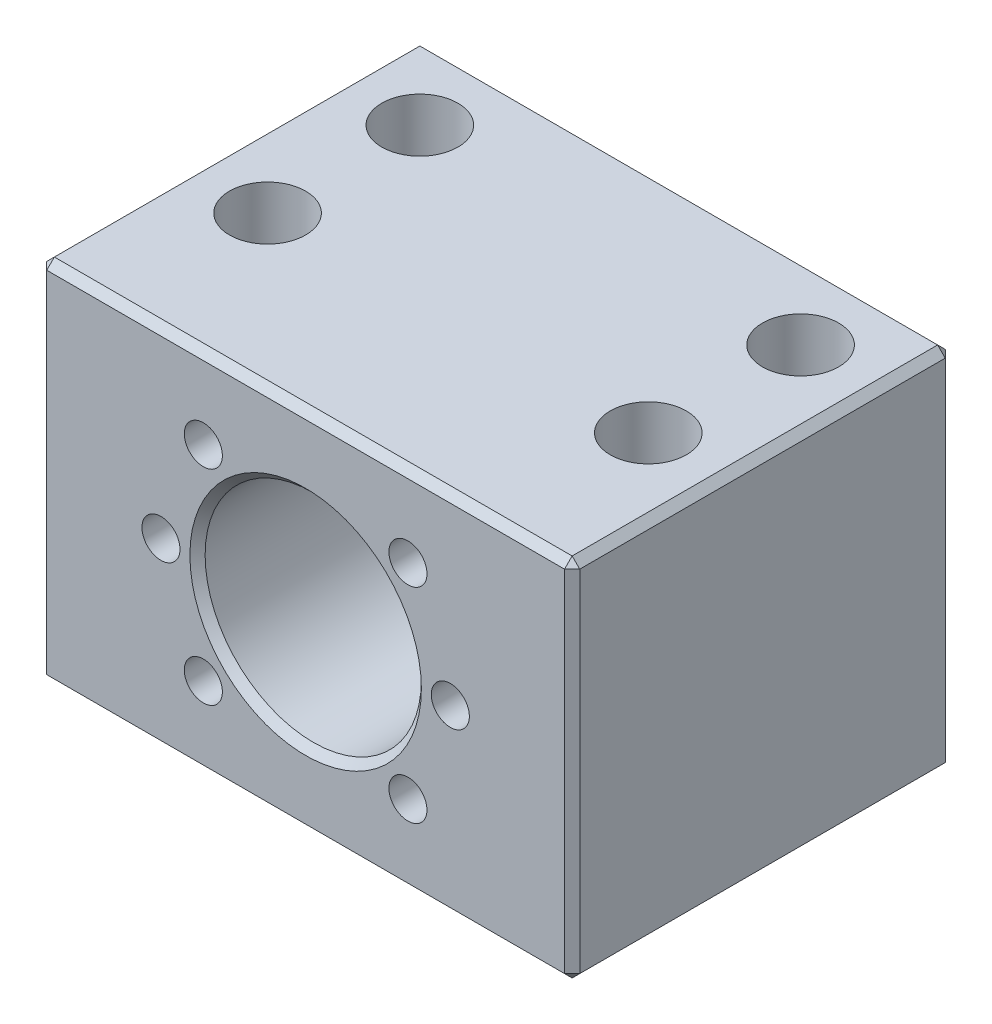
ISO-10303-21;
HEADER;
FILE_DESCRIPTION(('STEP AP214'),'2;1');
FILE_NAME('part.step','',(''),(''),'','','');
FILE_SCHEMA(('AUTOMOTIVE_DESIGN { 1 0 10303 214 1 1 1 1 }'));
ENDSEC;
DATA;
#1=APPLICATION_CONTEXT('core data for automotive mechanical design processes');
#2=APPLICATION_PROTOCOL_DEFINITION('international standard','automotive_design',2000,#1);
#3=PRODUCT_CONTEXT('',#1,'mechanical');
#4=PRODUCT('Part','Part','',(#3));
#5=PRODUCT_RELATED_PRODUCT_CATEGORY('part','',(#4));
#6=PRODUCT_DEFINITION_FORMATION('','',#4);
#7=PRODUCT_DEFINITION_CONTEXT('part definition',#1,'design');
#8=PRODUCT_DEFINITION('design','',#6,#7);
#9=PRODUCT_DEFINITION_SHAPE('','',#8);
#10=(LENGTH_UNIT() NAMED_UNIT(*) SI_UNIT(.MILLI.,.METRE.));
#11=(NAMED_UNIT(*) PLANE_ANGLE_UNIT() SI_UNIT($,.RADIAN.));
#12=(NAMED_UNIT(*) SI_UNIT($,.STERADIAN.) SOLID_ANGLE_UNIT());
#13=UNCERTAINTY_MEASURE_WITH_UNIT(LENGTH_MEASURE(1.E-05),#10,'distance_accuracy_value','');
#14=(GEOMETRIC_REPRESENTATION_CONTEXT(3) GLOBAL_UNCERTAINTY_ASSIGNED_CONTEXT((#13)) GLOBAL_UNIT_ASSIGNED_CONTEXT((#10,
#11,#12)) REPRESENTATION_CONTEXT('',''));
#15=CARTESIAN_POINT('',(0.,0.,0.));
#16=DIRECTION('',(0.,0.,1.));
#17=DIRECTION('',(1.,0.,0.));
#18=AXIS2_PLACEMENT_3D('',#15,#16,#17);
#19=CARTESIAN_POINT('',(-13.4350288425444,13.4350288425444,-11.));
#20=DIRECTION('',(0.,0.,1.));
#21=DIRECTION('',(1.,0.,0.));
#22=AXIS2_PLACEMENT_3D('',#19,#20,#21);
#23=PLANE('',#22);
#24=CARTESIAN_POINT('',(-13.4350288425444,13.4350288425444,-11.));
#25=DIRECTION('',(0.,0.,-1.));
#26=DIRECTION('',(1.,0.,0.));
#27=AXIS2_PLACEMENT_3D('',#24,#25,#26);
#28=CIRCLE('',#27,2.5);
#29=CARTESIAN_POINT('',(-10.9350288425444,13.4350288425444,-11.));
#30=VERTEX_POINT('',#29);
#31=CARTESIAN_POINT('',(-15.9350288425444,13.4350288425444,-11.));
#32=VERTEX_POINT('',#31);
#33=EDGE_CURVE('E9',#30,#32,#28,.T.);
#34=ORIENTED_EDGE('',*,*,#33,.F.);
#35=CARTESIAN_POINT('',(-13.4350288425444,13.4350288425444,-11.));
#36=DIRECTION('',(0.,0.,-1.));
#37=DIRECTION('',(1.,0.,0.));
#38=AXIS2_PLACEMENT_3D('',#35,#36,#37);
#39=CIRCLE('',#38,2.5);
#40=EDGE_CURVE('E25',#32,#30,#39,.T.);
#41=ORIENTED_EDGE('',*,*,#40,.F.);
#42=EDGE_LOOP('',(#34,#41));
#43=FACE_BOUND('',#42,.T.);
#44=ADVANCED_FACE('F15',(#43),#23,.T.);
#45=CARTESIAN_POINT('',(-13.4350288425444,13.4350288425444,0.));
#46=DIRECTION('',(0.,0.,-1.));
#47=DIRECTION('',(1.,0.,0.));
#48=AXIS2_PLACEMENT_3D('',#45,#46,#47);
#49=CYLINDRICAL_SURFACE('',#48,2.5);
#50=CARTESIAN_POINT('',(-13.4350288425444,13.4350288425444,0.));
#51=DIRECTION('',(0.,0.,-1.));
#52=DIRECTION('',(1.,0.,0.));
#53=AXIS2_PLACEMENT_3D('',#50,#51,#52);
#54=CIRCLE('',#53,2.5);
#55=CARTESIAN_POINT('',(-10.9350288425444,13.4350288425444,0.));
#56=VERTEX_POINT('',#55);
#57=CARTESIAN_POINT('',(-15.9350288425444,13.4350288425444,0.));
#58=VERTEX_POINT('',#57);
#59=EDGE_CURVE('E831',#56,#58,#54,.T.);
#60=ORIENTED_EDGE('',*,*,#59,.F.);
#61=CARTESIAN_POINT('',(-13.4350288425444,13.4350288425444,0.));
#62=DIRECTION('',(0.,0.,-1.));
#63=DIRECTION('',(1.,0.,0.));
#64=AXIS2_PLACEMENT_3D('',#61,#62,#63);
#65=CIRCLE('',#64,2.5);
#66=EDGE_CURVE('E838',#58,#56,#65,.T.);
#67=ORIENTED_EDGE('',*,*,#66,.F.);
#68=DIRECTION('',(0.,0.,-1.));
#69=VECTOR('',#68,1.);
#70=CARTESIAN_POINT('',(-15.9350288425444,13.4350288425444,0.));
#71=LINE('',#70,#69);
#72=EDGE_CURVE('E460',#58,#32,#71,.T.);
#73=ORIENTED_EDGE('',*,*,#72,.T.);
#74=ORIENTED_EDGE('',*,*,#40,.T.);
#75=ORIENTED_EDGE('',*,*,#33,.T.);
#76=ORIENTED_EDGE('',*,*,#72,.F.);
#77=EDGE_LOOP('',(#60,#67,#73,#74,#75,#76));
#78=FACE_BOUND('',#77,.T.);
#79=ADVANCED_FACE('F17',(#78),#49,.F.);
#80=CARTESIAN_POINT('',(-13.4350288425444,-13.4350288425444,-11.));
#81=DIRECTION('',(0.,0.,1.));
#82=DIRECTION('',(1.,0.,0.));
#83=AXIS2_PLACEMENT_3D('',#80,#81,#82);
#84=PLANE('',#83);
#85=CARTESIAN_POINT('',(-13.4350288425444,-13.4350288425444,-11.));
#86=DIRECTION('',(0.,0.,-1.));
#87=DIRECTION('',(1.,0.,0.));
#88=AXIS2_PLACEMENT_3D('',#85,#86,#87);
#89=CIRCLE('',#88,2.5);
#90=CARTESIAN_POINT('',(-10.9350288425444,-13.4350288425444,-11.));
#91=VERTEX_POINT('',#90);
#92=CARTESIAN_POINT('',(-15.9350288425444,-13.4350288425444,-11.));
#93=VERTEX_POINT('',#92);
#94=EDGE_CURVE('E458',#91,#93,#89,.T.);
#95=ORIENTED_EDGE('',*,*,#94,.F.);
#96=CARTESIAN_POINT('',(-13.4350288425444,-13.4350288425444,-11.));
#97=DIRECTION('',(0.,0.,-1.));
#98=DIRECTION('',(1.,0.,0.));
#99=AXIS2_PLACEMENT_3D('',#96,#97,#98);
#100=CIRCLE('',#99,2.5);
#101=EDGE_CURVE('E455',#93,#91,#100,.T.);
#102=ORIENTED_EDGE('',*,*,#101,.F.);
#103=EDGE_LOOP('',(#95,#102));
#104=FACE_BOUND('',#103,.T.);
#105=ADVANCED_FACE('F1086',(#104),#84,.T.);
#106=CARTESIAN_POINT('',(-13.4350288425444,-13.4350288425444,0.));
#107=DIRECTION('',(0.,0.,-1.));
#108=DIRECTION('',(1.,0.,0.));
#109=AXIS2_PLACEMENT_3D('',#106,#107,#108);
#110=CYLINDRICAL_SURFACE('',#109,2.5);
#111=CARTESIAN_POINT('',(-13.4350288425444,-13.4350288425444,0.));
#112=DIRECTION('',(0.,0.,-1.));
#113=DIRECTION('',(1.,0.,0.));
#114=AXIS2_PLACEMENT_3D('',#111,#112,#113);
#115=CIRCLE('',#114,2.5);
#116=CARTESIAN_POINT('',(-10.9350288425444,-13.4350288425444,0.));
#117=VERTEX_POINT('',#116);
#118=CARTESIAN_POINT('',(-15.9350288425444,-13.4350288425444,0.));
#119=VERTEX_POINT('',#118);
#120=EDGE_CURVE('E824',#117,#119,#115,.T.);
#121=ORIENTED_EDGE('',*,*,#120,.F.);
#122=CARTESIAN_POINT('',(-13.4350288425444,-13.4350288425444,0.));
#123=DIRECTION('',(0.,0.,-1.));
#124=DIRECTION('',(1.,0.,0.));
#125=AXIS2_PLACEMENT_3D('',#122,#123,#124);
#126=CIRCLE('',#125,2.5);
#127=EDGE_CURVE('E828',#119,#117,#126,.T.);
#128=ORIENTED_EDGE('',*,*,#127,.F.);
#129=DIRECTION('',(0.,0.,-1.));
#130=VECTOR('',#129,1.);
#131=CARTESIAN_POINT('',(-15.9350288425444,-13.4350288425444,0.));
#132=LINE('',#131,#130);
#133=EDGE_CURVE('E436',#119,#93,#132,.T.);
#134=ORIENTED_EDGE('',*,*,#133,.T.);
#135=ORIENTED_EDGE('',*,*,#101,.T.);
#136=ORIENTED_EDGE('',*,*,#94,.T.);
#137=ORIENTED_EDGE('',*,*,#133,.F.);
#138=EDGE_LOOP('',(#121,#128,#134,#135,#136,#137));
#139=FACE_BOUND('',#138,.T.);
#140=ADVANCED_FACE('F1228',(#139),#110,.F.);
#141=CARTESIAN_POINT('',(13.4350288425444,-13.4350288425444,-11.));
#142=DIRECTION('',(0.,0.,1.));
#143=DIRECTION('',(1.,0.,0.));
#144=AXIS2_PLACEMENT_3D('',#141,#142,#143);
#145=PLANE('',#144);
#146=CARTESIAN_POINT('',(13.4350288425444,-13.4350288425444,-11.));
#147=DIRECTION('',(0.,0.,-1.));
#148=DIRECTION('',(1.,0.,0.));
#149=AXIS2_PLACEMENT_3D('',#146,#147,#148);
#150=CIRCLE('',#149,2.5);
#151=CARTESIAN_POINT('',(15.9350288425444,-13.4350288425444,-11.));
#152=VERTEX_POINT('',#151);
#153=CARTESIAN_POINT('',(10.9350288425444,-13.4350288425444,-11.));
#154=VERTEX_POINT('',#153);
#155=EDGE_CURVE('E429',#152,#154,#150,.T.);
#156=ORIENTED_EDGE('',*,*,#155,.F.);
#157=CARTESIAN_POINT('',(13.4350288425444,-13.4350288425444,-11.));
#158=DIRECTION('',(0.,0.,-1.));
#159=DIRECTION('',(1.,0.,0.));
#160=AXIS2_PLACEMENT_3D('',#157,#158,#159);
#161=CIRCLE('',#160,2.5);
#162=EDGE_CURVE('E432',#154,#152,#161,.T.);
#163=ORIENTED_EDGE('',*,*,#162,.F.);
#164=EDGE_LOOP('',(#156,#163));
#165=FACE_BOUND('',#164,.T.);
#166=ADVANCED_FACE('F431',(#165),#145,.T.);
#167=CARTESIAN_POINT('',(13.4350288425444,-13.4350288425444,0.));
#168=DIRECTION('',(0.,0.,-1.));
#169=DIRECTION('',(1.,0.,0.));
#170=AXIS2_PLACEMENT_3D('',#167,#168,#169);
#171=CYLINDRICAL_SURFACE('',#170,2.5);
#172=CARTESIAN_POINT('',(13.4350288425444,-13.4350288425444,0.));
#173=DIRECTION('',(0.,0.,-1.));
#174=DIRECTION('',(1.,0.,0.));
#175=AXIS2_PLACEMENT_3D('',#172,#173,#174);
#176=CIRCLE('',#175,2.5);
#177=CARTESIAN_POINT('',(15.9350288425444,-13.4350288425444,0.));
#178=VERTEX_POINT('',#177);
#179=CARTESIAN_POINT('',(10.9350288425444,-13.4350288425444,0.));
#180=VERTEX_POINT('',#179);
#181=EDGE_CURVE('E796',#178,#180,#176,.T.);
#182=ORIENTED_EDGE('',*,*,#181,.F.);
#183=CARTESIAN_POINT('',(13.4350288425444,-13.4350288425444,0.));
#184=DIRECTION('',(0.,0.,-1.));
#185=DIRECTION('',(1.,0.,0.));
#186=AXIS2_PLACEMENT_3D('',#183,#184,#185);
#187=CIRCLE('',#186,2.5);
#188=EDGE_CURVE('E819',#180,#178,#187,.T.);
#189=ORIENTED_EDGE('',*,*,#188,.F.);
#190=DIRECTION('',(0.,0.,-1.));
#191=VECTOR('',#190,1.);
#192=CARTESIAN_POINT('',(10.9350288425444,-13.4350288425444,0.));
#193=LINE('',#192,#191);
#194=EDGE_CURVE('E441',#180,#154,#193,.T.);
#195=ORIENTED_EDGE('',*,*,#194,.T.);
#196=ORIENTED_EDGE('',*,*,#162,.T.);
#197=ORIENTED_EDGE('',*,*,#155,.T.);
#198=ORIENTED_EDGE('',*,*,#194,.F.);
#199=EDGE_LOOP('',(#182,#189,#195,#196,#197,#198));
#200=FACE_BOUND('',#199,.T.);
#201=ADVANCED_FACE('F439',(#200),#171,.F.);
#202=CARTESIAN_POINT('',(13.4350288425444,13.4350288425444,-11.));
#203=DIRECTION('',(0.,0.,1.));
#204=DIRECTION('',(1.,0.,0.));
#205=AXIS2_PLACEMENT_3D('',#202,#203,#204);
#206=PLANE('',#205);
#207=CARTESIAN_POINT('',(13.4350288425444,13.4350288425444,-11.));
#208=DIRECTION('',(0.,0.,-1.));
#209=DIRECTION('',(1.,0.,0.));
#210=AXIS2_PLACEMENT_3D('',#207,#208,#209);
#211=CIRCLE('',#210,2.5);
#212=CARTESIAN_POINT('',(15.9350288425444,13.4350288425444,-11.));
#213=VERTEX_POINT('',#212);
#214=CARTESIAN_POINT('',(10.9350288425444,13.4350288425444,-11.));
#215=VERTEX_POINT('',#214);
#216=EDGE_CURVE('E448',#213,#215,#211,.T.);
#217=ORIENTED_EDGE('',*,*,#216,.F.);
#218=CARTESIAN_POINT('',(13.4350288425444,13.4350288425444,-11.));
#219=DIRECTION('',(0.,0.,-1.));
#220=DIRECTION('',(1.,0.,0.));
#221=AXIS2_PLACEMENT_3D('',#218,#219,#220);
#222=CIRCLE('',#221,2.5);
#223=EDGE_CURVE('E778',#215,#213,#222,.T.);
#224=ORIENTED_EDGE('',*,*,#223,.F.);
#225=EDGE_LOOP('',(#217,#224));
#226=FACE_BOUND('',#225,.T.);
#227=ADVANCED_FACE('F790',(#226),#206,.T.);
#228=CARTESIAN_POINT('',(13.4350288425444,13.4350288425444,0.));
#229=DIRECTION('',(0.,0.,-1.));
#230=DIRECTION('',(1.,0.,0.));
#231=AXIS2_PLACEMENT_3D('',#228,#229,#230);
#232=CYLINDRICAL_SURFACE('',#231,2.5);
#233=CARTESIAN_POINT('',(13.4350288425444,13.4350288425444,0.));
#234=DIRECTION('',(0.,0.,-1.));
#235=DIRECTION('',(1.,0.,0.));
#236=AXIS2_PLACEMENT_3D('',#233,#234,#235);
#237=CIRCLE('',#236,2.5);
#238=CARTESIAN_POINT('',(15.9350288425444,13.4350288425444,0.));
#239=VERTEX_POINT('',#238);
#240=CARTESIAN_POINT('',(10.9350288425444,13.4350288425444,0.));
#241=VERTEX_POINT('',#240);
#242=EDGE_CURVE('E793',#239,#241,#237,.T.);
#243=ORIENTED_EDGE('',*,*,#242,.F.);
#244=CARTESIAN_POINT('',(13.4350288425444,13.4350288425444,0.));
#245=DIRECTION('',(0.,0.,-1.));
#246=DIRECTION('',(1.,0.,0.));
#247=AXIS2_PLACEMENT_3D('',#244,#245,#246);
#248=CIRCLE('',#247,2.5);
#249=EDGE_CURVE('E791',#241,#239,#248,.T.);
#250=ORIENTED_EDGE('',*,*,#249,.F.);
#251=DIRECTION('',(0.,0.,-1.));
#252=VECTOR('',#251,1.);
#253=CARTESIAN_POINT('',(10.9350288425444,13.4350288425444,0.));
#254=LINE('',#253,#252);
#255=EDGE_CURVE('E774',#241,#215,#254,.T.);
#256=ORIENTED_EDGE('',*,*,#255,.T.);
#257=ORIENTED_EDGE('',*,*,#223,.T.);
#258=ORIENTED_EDGE('',*,*,#216,.T.);
#259=ORIENTED_EDGE('',*,*,#255,.F.);
#260=EDGE_LOOP('',(#243,#250,#256,#257,#258,#259));
#261=FACE_BOUND('',#260,.T.);
#262=ADVANCED_FACE('F787',(#261),#232,.F.);
#263=CARTESIAN_POINT('',(-19.,0.,-11.));
#264=DIRECTION('',(0.,0.,1.));
#265=DIRECTION('',(1.,0.,0.));
#266=AXIS2_PLACEMENT_3D('',#263,#264,#265);
#267=PLANE('',#266);
#268=CARTESIAN_POINT('',(-19.,0.,-11.));
#269=DIRECTION('',(0.,0.,-1.));
#270=DIRECTION('',(1.,0.,0.));
#271=AXIS2_PLACEMENT_3D('',#268,#269,#270);
#272=CIRCLE('',#271,2.5);
#273=CARTESIAN_POINT('',(-16.5,0.,-11.));
#274=VERTEX_POINT('',#273);
#275=CARTESIAN_POINT('',(-21.5,0.,-11.));
#276=VERTEX_POINT('',#275);
#277=EDGE_CURVE('E771',#274,#276,#272,.T.);
#278=ORIENTED_EDGE('',*,*,#277,.F.);
#279=CARTESIAN_POINT('',(-19.,0.,-11.));
#280=DIRECTION('',(0.,0.,-1.));
#281=DIRECTION('',(1.,0.,0.));
#282=AXIS2_PLACEMENT_3D('',#279,#280,#281);
#283=CIRCLE('',#282,2.5);
#284=EDGE_CURVE('E767',#276,#274,#283,.T.);
#285=ORIENTED_EDGE('',*,*,#284,.F.);
#286=EDGE_LOOP('',(#278,#285));
#287=FACE_BOUND('',#286,.T.);
#288=ADVANCED_FACE('F1202',(#287),#267,.T.);
#289=CARTESIAN_POINT('',(-19.,0.,0.));
#290=DIRECTION('',(0.,0.,-1.));
#291=DIRECTION('',(1.,0.,0.));
#292=AXIS2_PLACEMENT_3D('',#289,#290,#291);
#293=CYLINDRICAL_SURFACE('',#292,2.5);
#294=CARTESIAN_POINT('',(-19.,0.,0.));
#295=DIRECTION('',(0.,0.,-1.));
#296=DIRECTION('',(1.,0.,0.));
#297=AXIS2_PLACEMENT_3D('',#294,#295,#296);
#298=CIRCLE('',#297,2.5);
#299=CARTESIAN_POINT('',(-16.5,0.,0.));
#300=VERTEX_POINT('',#299);
#301=CARTESIAN_POINT('',(-21.5,0.,0.));
#302=VERTEX_POINT('',#301);
#303=EDGE_CURVE('E806',#300,#302,#298,.T.);
#304=ORIENTED_EDGE('',*,*,#303,.F.);
#305=CARTESIAN_POINT('',(-19.,0.,0.));
#306=DIRECTION('',(0.,0.,-1.));
#307=DIRECTION('',(1.,0.,0.));
#308=AXIS2_PLACEMENT_3D('',#305,#306,#307);
#309=CIRCLE('',#308,2.5);
#310=EDGE_CURVE('E801',#302,#300,#309,.T.);
#311=ORIENTED_EDGE('',*,*,#310,.F.);
#312=DIRECTION('',(0.,0.,-1.));
#313=VECTOR('',#312,1.);
#314=CARTESIAN_POINT('',(-21.5,0.,0.));
#315=LINE('',#314,#313);
#316=EDGE_CURVE('E763',#302,#276,#315,.T.);
#317=ORIENTED_EDGE('',*,*,#316,.T.);
#318=ORIENTED_EDGE('',*,*,#284,.T.);
#319=ORIENTED_EDGE('',*,*,#277,.T.);
#320=ORIENTED_EDGE('',*,*,#316,.F.);
#321=EDGE_LOOP('',(#304,#311,#317,#318,#319,#320));
#322=FACE_BOUND('',#321,.T.);
#323=ADVANCED_FACE('F1198',(#322),#293,.F.);
#324=CARTESIAN_POINT('',(19.,0.,-11.));
#325=DIRECTION('',(0.,0.,1.));
#326=DIRECTION('',(1.,0.,0.));
#327=AXIS2_PLACEMENT_3D('',#324,#325,#326);
#328=PLANE('',#327);
#329=CARTESIAN_POINT('',(19.,0.,-11.));
#330=DIRECTION('',(0.,0.,-1.));
#331=DIRECTION('',(1.,0.,0.));
#332=AXIS2_PLACEMENT_3D('',#329,#330,#331);
#333=CIRCLE('',#332,2.5);
#334=CARTESIAN_POINT('',(21.5,0.,-11.));
#335=VERTEX_POINT('',#334);
#336=CARTESIAN_POINT('',(16.5,0.,-11.));
#337=VERTEX_POINT('',#336);
#338=EDGE_CURVE('E760',#335,#337,#333,.T.);
#339=ORIENTED_EDGE('',*,*,#338,.F.);
#340=CARTESIAN_POINT('',(19.,0.,-11.));
#341=DIRECTION('',(0.,0.,-1.));
#342=DIRECTION('',(1.,0.,0.));
#343=AXIS2_PLACEMENT_3D('',#340,#341,#342);
#344=CIRCLE('',#343,2.5);
#345=EDGE_CURVE('E756',#337,#335,#344,.T.);
#346=ORIENTED_EDGE('',*,*,#345,.F.);
#347=EDGE_LOOP('',(#339,#346));
#348=FACE_BOUND('',#347,.T.);
#349=ADVANCED_FACE('F1201',(#348),#328,.T.);
#350=CARTESIAN_POINT('',(19.,0.,0.));
#351=DIRECTION('',(0.,0.,-1.));
#352=DIRECTION('',(1.,0.,0.));
#353=AXIS2_PLACEMENT_3D('',#350,#351,#352);
#354=CYLINDRICAL_SURFACE('',#353,2.5);
#355=CARTESIAN_POINT('',(19.,0.,0.));
#356=DIRECTION('',(0.,0.,-1.));
#357=DIRECTION('',(1.,0.,0.));
#358=AXIS2_PLACEMENT_3D('',#355,#356,#357);
#359=CIRCLE('',#358,2.5);
#360=CARTESIAN_POINT('',(21.5,0.,0.));
#361=VERTEX_POINT('',#360);
#362=CARTESIAN_POINT('',(16.5,0.,0.));
#363=VERTEX_POINT('',#362);
#364=EDGE_CURVE('E963',#361,#363,#359,.T.);
#365=ORIENTED_EDGE('',*,*,#364,.F.);
#366=CARTESIAN_POINT('',(19.,0.,0.));
#367=DIRECTION('',(0.,0.,-1.));
#368=DIRECTION('',(1.,0.,0.));
#369=AXIS2_PLACEMENT_3D('',#366,#367,#368);
#370=CIRCLE('',#369,2.5);
#371=EDGE_CURVE('E1035',#363,#361,#370,.T.);
#372=ORIENTED_EDGE('',*,*,#371,.F.);
#373=DIRECTION('',(0.,0.,-1.));
#374=VECTOR('',#373,1.);
#375=CARTESIAN_POINT('',(16.5,0.,0.));
#376=LINE('',#375,#374);
#377=EDGE_CURVE('E755',#363,#337,#376,.T.);
#378=ORIENTED_EDGE('',*,*,#377,.T.);
#379=ORIENTED_EDGE('',*,*,#345,.T.);
#380=ORIENTED_EDGE('',*,*,#338,.T.);
#381=ORIENTED_EDGE('',*,*,#377,.F.);
#382=EDGE_LOOP('',(#365,#372,#378,#379,#380,#381));
#383=FACE_BOUND('',#382,.T.);
#384=ADVANCED_FACE('F1209',(#383),#354,.F.);
#385=CARTESIAN_POINT('',(-25.,24.,-40.));
#386=DIRECTION('',(0.,-1.,0.));
#387=DIRECTION('',(1.,0.,0.));
#388=AXIS2_PLACEMENT_3D('',#385,#386,#387);
#389=CYLINDRICAL_SURFACE('',#388,4.2);
#390=CARTESIAN_POINT('',(-25.,9.,-40.));
#391=DIRECTION('',(0.,1.,0.));
#392=DIRECTION('',(1.,0.,0.));
#393=AXIS2_PLACEMENT_3D('',#390,#391,#392);
#394=CIRCLE('',#393,4.2);
#395=CARTESIAN_POINT('',(-29.2,9.,-40.));
#396=VERTEX_POINT('',#395);
#397=EDGE_CURVE('E487',#396,#396,#394,.T.);
#398=ORIENTED_EDGE('',*,*,#397,.T.);
#399=DIRECTION('',(0.,-1.,0.));
#400=VECTOR('',#399,1.);
#401=CARTESIAN_POINT('',(-29.2,24.,-40.));
#402=LINE('',#401,#400);
#403=CARTESIAN_POINT('',(-29.2,-13.,-40.));
#404=VERTEX_POINT('',#403);
#405=EDGE_CURVE('E752',#396,#404,#402,.T.);
#406=ORIENTED_EDGE('',*,*,#405,.T.);
#407=CARTESIAN_POINT('',(-25.,-13.,-40.));
#408=DIRECTION('',(0.,-1.,0.));
#409=DIRECTION('',(1.,0.,0.));
#410=AXIS2_PLACEMENT_3D('',#407,#408,#409);
#411=CIRCLE('',#410,4.2);
#412=CARTESIAN_POINT('',(-20.8,-13.,-40.));
#413=VERTEX_POINT('',#412);
#414=EDGE_CURVE('E679',#404,#413,#411,.T.);
#415=ORIENTED_EDGE('',*,*,#414,.T.);
#416=CARTESIAN_POINT('',(-25.,-13.,-40.));
#417=DIRECTION('',(0.,-1.,0.));
#418=DIRECTION('',(1.,0.,0.));
#419=AXIS2_PLACEMENT_3D('',#416,#417,#418);
#420=CIRCLE('',#419,4.2);
#421=EDGE_CURVE('E515',#413,#404,#420,.T.);
#422=ORIENTED_EDGE('',*,*,#421,.T.);
#423=ORIENTED_EDGE('',*,*,#405,.F.);
#424=EDGE_LOOP('',(#398,#406,#415,#422,#423));
#425=FACE_BOUND('',#424,.T.);
#426=ADVANCED_FACE('F1181',(#425),#389,.F.);
#427=CARTESIAN_POINT('',(25.,24.,-20.));
#428=DIRECTION('',(0.,-1.,0.));
#429=DIRECTION('',(1.,0.,0.));
#430=AXIS2_PLACEMENT_3D('',#427,#428,#429);
#431=CYLINDRICAL_SURFACE('',#430,4.2);
#432=CARTESIAN_POINT('',(25.,9.,-20.));
#433=DIRECTION('',(0.,1.,0.));
#434=DIRECTION('',(1.,0.,0.));
#435=AXIS2_PLACEMENT_3D('',#432,#433,#434);
#436=CIRCLE('',#435,4.2);
#437=CARTESIAN_POINT('',(20.8,9.,-20.));
#438=VERTEX_POINT('',#437);
#439=EDGE_CURVE('E544',#438,#438,#436,.T.);
#440=ORIENTED_EDGE('',*,*,#439,.T.);
#441=DIRECTION('',(0.,-1.,0.));
#442=VECTOR('',#441,1.);
#443=CARTESIAN_POINT('',(20.8,24.,-20.));
#444=LINE('',#443,#442);
#445=CARTESIAN_POINT('',(20.8,-13.,-20.));
#446=VERTEX_POINT('',#445);
#447=EDGE_CURVE('E749',#438,#446,#444,.T.);
#448=ORIENTED_EDGE('',*,*,#447,.T.);
#449=CARTESIAN_POINT('',(25.,-13.,-20.));
#450=DIRECTION('',(0.,-1.,0.));
#451=DIRECTION('',(1.,0.,0.));
#452=AXIS2_PLACEMENT_3D('',#449,#450,#451);
#453=CIRCLE('',#452,4.2);
#454=CARTESIAN_POINT('',(29.2,-13.,-20.));
#455=VERTEX_POINT('',#454);
#456=EDGE_CURVE('E512',#446,#455,#453,.T.);
#457=ORIENTED_EDGE('',*,*,#456,.T.);
#458=CARTESIAN_POINT('',(25.,-13.,-20.));
#459=DIRECTION('',(0.,-1.,0.));
#460=DIRECTION('',(1.,0.,0.));
#461=AXIS2_PLACEMENT_3D('',#458,#459,#460);
#462=CIRCLE('',#461,4.2);
#463=EDGE_CURVE('E516',#455,#446,#462,.T.);
#464=ORIENTED_EDGE('',*,*,#463,.T.);
#465=ORIENTED_EDGE('',*,*,#447,.F.);
#466=EDGE_LOOP('',(#440,#448,#457,#464,#465));
#467=FACE_BOUND('',#466,.T.);
#468=ADVANCED_FACE('F1177',(#467),#431,.F.);
#469=CARTESIAN_POINT('',(25.,24.,-40.));
#470=DIRECTION('',(0.,-1.,0.));
#471=DIRECTION('',(1.,0.,0.));
#472=AXIS2_PLACEMENT_3D('',#469,#470,#471);
#473=CYLINDRICAL_SURFACE('',#472,4.2);
#474=CARTESIAN_POINT('',(25.,9.,-40.));
#475=DIRECTION('',(0.,1.,0.));
#476=DIRECTION('',(1.,0.,0.));
#477=AXIS2_PLACEMENT_3D('',#474,#475,#476);
#478=CIRCLE('',#477,4.2);
#479=CARTESIAN_POINT('',(20.8,9.,-40.));
#480=VERTEX_POINT('',#479);
#481=EDGE_CURVE('E564',#480,#480,#478,.T.);
#482=ORIENTED_EDGE('',*,*,#481,.T.);
#483=DIRECTION('',(0.,-1.,0.));
#484=VECTOR('',#483,1.);
#485=CARTESIAN_POINT('',(20.8,24.,-40.));
#486=LINE('',#485,#484);
#487=CARTESIAN_POINT('',(20.8,-13.,-40.));
#488=VERTEX_POINT('',#487);
#489=EDGE_CURVE('E746',#480,#488,#486,.T.);
#490=ORIENTED_EDGE('',*,*,#489,.T.);
#491=CARTESIAN_POINT('',(25.,-13.,-40.));
#492=DIRECTION('',(0.,-1.,0.));
#493=DIRECTION('',(1.,0.,0.));
#494=AXIS2_PLACEMENT_3D('',#491,#492,#493);
#495=CIRCLE('',#494,4.2);
#496=CARTESIAN_POINT('',(29.2,-13.,-40.));
#497=VERTEX_POINT('',#496);
#498=EDGE_CURVE('E615',#488,#497,#495,.T.);
#499=ORIENTED_EDGE('',*,*,#498,.T.);
#500=CARTESIAN_POINT('',(25.,-13.,-40.));
#501=DIRECTION('',(0.,-1.,0.));
#502=DIRECTION('',(1.,0.,0.));
#503=AXIS2_PLACEMENT_3D('',#500,#501,#502);
#504=CIRCLE('',#503,4.2);
#505=EDGE_CURVE('E619',#497,#488,#504,.T.);
#506=ORIENTED_EDGE('',*,*,#505,.T.);
#507=ORIENTED_EDGE('',*,*,#489,.F.);
#508=EDGE_LOOP('',(#482,#490,#499,#506,#507));
#509=FACE_BOUND('',#508,.T.);
#510=ADVANCED_FACE('F1180',(#509),#473,.F.);
#511=CARTESIAN_POINT('',(-25.,24.,-20.));
#512=DIRECTION('',(0.,-1.,0.));
#513=DIRECTION('',(1.,0.,0.));
#514=AXIS2_PLACEMENT_3D('',#511,#512,#513);
#515=CYLINDRICAL_SURFACE('',#514,4.2);
#516=CARTESIAN_POINT('',(-25.,9.,-20.));
#517=DIRECTION('',(0.,1.,0.));
#518=DIRECTION('',(1.,0.,0.));
#519=AXIS2_PLACEMENT_3D('',#516,#517,#518);
#520=CIRCLE('',#519,4.2);
#521=CARTESIAN_POINT('',(-29.2,9.,-20.));
#522=VERTEX_POINT('',#521);
#523=EDGE_CURVE('E624',#522,#522,#520,.T.);
#524=ORIENTED_EDGE('',*,*,#523,.T.);
#525=DIRECTION('',(0.,-1.,0.));
#526=VECTOR('',#525,1.);
#527=CARTESIAN_POINT('',(-29.2,24.,-20.));
#528=LINE('',#527,#526);
#529=CARTESIAN_POINT('',(-29.2,-13.,-20.));
#530=VERTEX_POINT('',#529);
#531=EDGE_CURVE('E743',#522,#530,#528,.T.);
#532=ORIENTED_EDGE('',*,*,#531,.T.);
#533=CARTESIAN_POINT('',(-25.,-13.,-20.));
#534=DIRECTION('',(0.,-1.,0.));
#535=DIRECTION('',(1.,0.,0.));
#536=AXIS2_PLACEMENT_3D('',#533,#534,#535);
#537=CIRCLE('',#536,4.2);
#538=CARTESIAN_POINT('',(-20.8,-13.,-20.));
#539=VERTEX_POINT('',#538);
#540=EDGE_CURVE('E662',#530,#539,#537,.T.);
#541=ORIENTED_EDGE('',*,*,#540,.T.);
#542=CARTESIAN_POINT('',(-25.,-13.,-20.));
#543=DIRECTION('',(0.,-1.,0.));
#544=DIRECTION('',(1.,0.,0.));
#545=AXIS2_PLACEMENT_3D('',#542,#543,#544);
#546=CIRCLE('',#545,4.2);
#547=EDGE_CURVE('E722',#539,#530,#546,.T.);
#548=ORIENTED_EDGE('',*,*,#547,.T.);
#549=ORIENTED_EDGE('',*,*,#531,.F.);
#550=EDGE_LOOP('',(#524,#532,#541,#548,#549));
#551=FACE_BOUND('',#550,.T.);
#552=ADVANCED_FACE('F1193',(#551),#515,.F.);
#553=CARTESIAN_POINT('',(-25.,9.,-40.));
#554=DIRECTION('',(0.,1.,0.));
#555=DIRECTION('',(1.,0.,0.));
#556=AXIS2_PLACEMENT_3D('',#553,#554,#555);
#557=PLANE('',#556);
#558=ORIENTED_EDGE('',*,*,#397,.F.);
#559=EDGE_LOOP('',(#558));
#560=FACE_BOUND('',#559,.T.);
#561=CARTESIAN_POINT('',(-25.,9.,-40.));
#562=DIRECTION('',(0.,-1.,0.));
#563=DIRECTION('',(1.,0.,0.));
#564=AXIS2_PLACEMENT_3D('',#561,#562,#563);
#565=CIRCLE('',#564,5.);
#566=CARTESIAN_POINT('',(-20.,9.,-40.));
#567=VERTEX_POINT('',#566);
#568=CARTESIAN_POINT('',(-30.,9.,-40.));
#569=VERTEX_POINT('',#568);
#570=EDGE_CURVE('E484',#567,#569,#565,.T.);
#571=ORIENTED_EDGE('',*,*,#570,.F.);
#572=CARTESIAN_POINT('',(-25.,9.,-40.));
#573=DIRECTION('',(0.,-1.,0.));
#574=DIRECTION('',(1.,0.,0.));
#575=AXIS2_PLACEMENT_3D('',#572,#573,#574);
#576=CIRCLE('',#575,5.);
#577=EDGE_CURVE('E488',#569,#567,#576,.T.);
#578=ORIENTED_EDGE('',*,*,#577,.F.);
#579=EDGE_LOOP('',(#571,#578));
#580=FACE_BOUND('',#579,.T.);
#581=ADVANCED_FACE('F1189',(#560,#580),#557,.T.);
#582=CARTESIAN_POINT('',(-25.,24.,-40.));
#583=DIRECTION('',(0.,-1.,0.));
#584=DIRECTION('',(1.,0.,0.));
#585=AXIS2_PLACEMENT_3D('',#582,#583,#584);
#586=CYLINDRICAL_SURFACE('',#585,5.);
#587=CARTESIAN_POINT('',(-25.,24.,-40.));
#588=DIRECTION('',(0.,-1.,0.));
#589=DIRECTION('',(1.,0.,0.));
#590=AXIS2_PLACEMENT_3D('',#587,#588,#589);
#591=CIRCLE('',#590,5.);
#592=CARTESIAN_POINT('',(-20.,24.,-40.));
#593=VERTEX_POINT('',#592);
#594=CARTESIAN_POINT('',(-30.,24.,-40.));
#595=VERTEX_POINT('',#594);
#596=EDGE_CURVE('E693',#593,#595,#591,.T.);
#597=ORIENTED_EDGE('',*,*,#596,.F.);
#598=CARTESIAN_POINT('',(-25.,24.,-40.));
#599=DIRECTION('',(0.,-1.,0.));
#600=DIRECTION('',(1.,0.,0.));
#601=AXIS2_PLACEMENT_3D('',#598,#599,#600);
#602=CIRCLE('',#601,5.);
#603=EDGE_CURVE('E697',#595,#593,#602,.T.);
#604=ORIENTED_EDGE('',*,*,#603,.F.);
#605=DIRECTION('',(0.,-1.,0.));
#606=VECTOR('',#605,1.);
#607=CARTESIAN_POINT('',(-30.,24.,-40.));
#608=LINE('',#607,#606);
#609=EDGE_CURVE('E628',#595,#569,#608,.T.);
#610=ORIENTED_EDGE('',*,*,#609,.T.);
#611=ORIENTED_EDGE('',*,*,#577,.T.);
#612=ORIENTED_EDGE('',*,*,#570,.T.);
#613=ORIENTED_EDGE('',*,*,#609,.F.);
#614=EDGE_LOOP('',(#597,#604,#610,#611,#612,#613));
#615=FACE_BOUND('',#614,.T.);
#616=ADVANCED_FACE('F1185',(#615),#586,.F.);
#617=CARTESIAN_POINT('',(-25.,9.,-20.));
#618=DIRECTION('',(0.,1.,0.));
#619=DIRECTION('',(1.,0.,0.));
#620=AXIS2_PLACEMENT_3D('',#617,#618,#619);
#621=PLANE('',#620);
#622=ORIENTED_EDGE('',*,*,#523,.F.);
#623=EDGE_LOOP('',(#622));
#624=FACE_BOUND('',#623,.T.);
#625=CARTESIAN_POINT('',(-25.,9.,-20.));
#626=DIRECTION('',(0.,-1.,0.));
#627=DIRECTION('',(1.,0.,0.));
#628=AXIS2_PLACEMENT_3D('',#625,#626,#627);
#629=CIRCLE('',#628,5.);
#630=CARTESIAN_POINT('',(-20.,9.,-20.));
#631=VERTEX_POINT('',#630);
#632=CARTESIAN_POINT('',(-30.,9.,-20.));
#633=VERTEX_POINT('',#632);
#634=EDGE_CURVE('E629',#631,#633,#629,.T.);
#635=ORIENTED_EDGE('',*,*,#634,.F.);
#636=CARTESIAN_POINT('',(-25.,9.,-20.));
#637=DIRECTION('',(0.,-1.,0.));
#638=DIRECTION('',(1.,0.,0.));
#639=AXIS2_PLACEMENT_3D('',#636,#637,#638);
#640=CIRCLE('',#639,5.);
#641=EDGE_CURVE('E675',#633,#631,#640,.T.);
#642=ORIENTED_EDGE('',*,*,#641,.F.);
#643=EDGE_LOOP('',(#635,#642));
#644=FACE_BOUND('',#643,.T.);
#645=ADVANCED_FACE('F1175',(#624,#644),#621,.T.);
#646=CARTESIAN_POINT('',(-25.,24.,-20.));
#647=DIRECTION('',(0.,-1.,0.));
#648=DIRECTION('',(1.,0.,0.));
#649=AXIS2_PLACEMENT_3D('',#646,#647,#648);
#650=CYLINDRICAL_SURFACE('',#649,5.);
#651=CARTESIAN_POINT('',(-25.,24.,-20.));
#652=DIRECTION('',(0.,-1.,0.));
#653=DIRECTION('',(1.,0.,0.));
#654=AXIS2_PLACEMENT_3D('',#651,#652,#653);
#655=CIRCLE('',#654,5.);
#656=CARTESIAN_POINT('',(-20.,24.,-20.));
#657=VERTEX_POINT('',#656);
#658=CARTESIAN_POINT('',(-30.,24.,-20.));
#659=VERTEX_POINT('',#658);
#660=EDGE_CURVE('E701',#657,#659,#655,.T.);
#661=ORIENTED_EDGE('',*,*,#660,.F.);
#662=CARTESIAN_POINT('',(-25.,24.,-20.));
#663=DIRECTION('',(0.,-1.,0.));
#664=DIRECTION('',(1.,0.,0.));
#665=AXIS2_PLACEMENT_3D('',#662,#663,#664);
#666=CIRCLE('',#665,5.);
#667=EDGE_CURVE('E705',#659,#657,#666,.T.);
#668=ORIENTED_EDGE('',*,*,#667,.F.);
#669=DIRECTION('',(0.,-1.,0.));
#670=VECTOR('',#669,1.);
#671=CARTESIAN_POINT('',(-30.,24.,-20.));
#672=LINE('',#671,#670);
#673=EDGE_CURVE('E568',#659,#633,#672,.T.);
#674=ORIENTED_EDGE('',*,*,#673,.T.);
#675=ORIENTED_EDGE('',*,*,#641,.T.);
#676=ORIENTED_EDGE('',*,*,#634,.T.);
#677=ORIENTED_EDGE('',*,*,#673,.F.);
#678=EDGE_LOOP('',(#661,#668,#674,#675,#676,#677));
#679=FACE_BOUND('',#678,.T.);
#680=ADVANCED_FACE('F1117',(#679),#650,.F.);
#681=CARTESIAN_POINT('',(25.,9.,-40.));
#682=DIRECTION('',(0.,1.,0.));
#683=DIRECTION('',(1.,0.,0.));
#684=AXIS2_PLACEMENT_3D('',#681,#682,#683);
#685=PLANE('',#684);
#686=ORIENTED_EDGE('',*,*,#481,.F.);
#687=EDGE_LOOP('',(#686));
#688=FACE_BOUND('',#687,.T.);
#689=CARTESIAN_POINT('',(25.,9.,-40.));
#690=DIRECTION('',(0.,-1.,0.));
#691=DIRECTION('',(1.,0.,0.));
#692=AXIS2_PLACEMENT_3D('',#689,#690,#691);
#693=CIRCLE('',#692,5.);
#694=CARTESIAN_POINT('',(30.,9.,-40.));
#695=VERTEX_POINT('',#694);
#696=CARTESIAN_POINT('',(20.,9.,-40.));
#697=VERTEX_POINT('',#696);
#698=EDGE_CURVE('E569',#695,#697,#693,.T.);
#699=ORIENTED_EDGE('',*,*,#698,.F.);
#700=CARTESIAN_POINT('',(25.,9.,-40.));
#701=DIRECTION('',(0.,-1.,0.));
#702=DIRECTION('',(1.,0.,0.));
#703=AXIS2_PLACEMENT_3D('',#700,#701,#702);
#704=CIRCLE('',#703,5.);
#705=EDGE_CURVE('E601',#697,#695,#704,.T.);
#706=ORIENTED_EDGE('',*,*,#705,.F.);
#707=EDGE_LOOP('',(#699,#706));
#708=FACE_BOUND('',#707,.T.);
#709=ADVANCED_FACE('F1075',(#688,#708),#685,.T.);
#710=CARTESIAN_POINT('',(25.,24.,-40.));
#711=DIRECTION('',(0.,-1.,0.));
#712=DIRECTION('',(1.,0.,0.));
#713=AXIS2_PLACEMENT_3D('',#710,#711,#712);
#714=CYLINDRICAL_SURFACE('',#713,5.);
#715=CARTESIAN_POINT('',(25.,24.,-40.));
#716=DIRECTION('',(0.,-1.,0.));
#717=DIRECTION('',(1.,0.,0.));
#718=AXIS2_PLACEMENT_3D('',#715,#716,#717);
#719=CIRCLE('',#718,5.);
#720=CARTESIAN_POINT('',(30.,24.,-40.));
#721=VERTEX_POINT('',#720);
#722=CARTESIAN_POINT('',(20.,24.,-40.));
#723=VERTEX_POINT('',#722);
#724=EDGE_CURVE('E710',#721,#723,#719,.T.);
#725=ORIENTED_EDGE('',*,*,#724,.F.);
#726=CARTESIAN_POINT('',(25.,24.,-40.));
#727=DIRECTION('',(0.,-1.,0.));
#728=DIRECTION('',(1.,0.,0.));
#729=AXIS2_PLACEMENT_3D('',#726,#727,#728);
#730=CIRCLE('',#729,5.);
#731=EDGE_CURVE('E706',#723,#721,#730,.T.);
#732=ORIENTED_EDGE('',*,*,#731,.F.);
#733=DIRECTION('',(0.,-1.,0.));
#734=VECTOR('',#733,1.);
#735=CARTESIAN_POINT('',(20.,24.,-40.));
#736=LINE('',#735,#734);
#737=EDGE_CURVE('E597',#723,#697,#736,.T.);
#738=ORIENTED_EDGE('',*,*,#737,.T.);
#739=ORIENTED_EDGE('',*,*,#705,.T.);
#740=ORIENTED_EDGE('',*,*,#698,.T.);
#741=ORIENTED_EDGE('',*,*,#737,.F.);
#742=EDGE_LOOP('',(#725,#732,#738,#739,#740,#741));
#743=FACE_BOUND('',#742,.T.);
#744=ADVANCED_FACE('F1065',(#743),#714,.F.);
#745=CARTESIAN_POINT('',(25.,9.,-20.));
#746=DIRECTION('',(0.,1.,0.));
#747=DIRECTION('',(1.,0.,0.));
#748=AXIS2_PLACEMENT_3D('',#745,#746,#747);
#749=PLANE('',#748);
#750=ORIENTED_EDGE('',*,*,#439,.F.);
#751=EDGE_LOOP('',(#750));
#752=FACE_BOUND('',#751,.T.);
#753=CARTESIAN_POINT('',(25.,9.,-20.));
#754=DIRECTION('',(0.,-1.,0.));
#755=DIRECTION('',(1.,0.,0.));
#756=AXIS2_PLACEMENT_3D('',#753,#754,#755);
#757=CIRCLE('',#756,5.);
#758=CARTESIAN_POINT('',(30.,9.,-20.));
#759=VERTEX_POINT('',#758);
#760=CARTESIAN_POINT('',(20.,9.,-20.));
#761=VERTEX_POINT('',#760);
#762=EDGE_CURVE('E541',#759,#761,#757,.T.);
#763=ORIENTED_EDGE('',*,*,#762,.F.);
#764=CARTESIAN_POINT('',(25.,9.,-20.));
#765=DIRECTION('',(0.,-1.,0.));
#766=DIRECTION('',(1.,0.,0.));
#767=AXIS2_PLACEMENT_3D('',#764,#765,#766);
#768=CIRCLE('',#767,5.);
#769=EDGE_CURVE('E545',#761,#759,#768,.T.);
#770=ORIENTED_EDGE('',*,*,#769,.F.);
#771=EDGE_LOOP('',(#763,#770));
#772=FACE_BOUND('',#771,.T.);
#773=ADVANCED_FACE('F1063',(#752,#772),#749,.T.);
#774=CARTESIAN_POINT('',(25.,24.,-20.));
#775=DIRECTION('',(0.,-1.,0.));
#776=DIRECTION('',(1.,0.,0.));
#777=AXIS2_PLACEMENT_3D('',#774,#775,#776);
#778=CYLINDRICAL_SURFACE('',#777,5.);
#779=CARTESIAN_POINT('',(25.,24.,-20.));
#780=DIRECTION('',(0.,-1.,0.));
#781=DIRECTION('',(1.,0.,0.));
#782=AXIS2_PLACEMENT_3D('',#779,#780,#781);
#783=CIRCLE('',#782,5.);
#784=CARTESIAN_POINT('',(30.,24.,-20.));
#785=VERTEX_POINT('',#784);
#786=CARTESIAN_POINT('',(20.,24.,-20.));
#787=VERTEX_POINT('',#786);
#788=EDGE_CURVE('E709',#785,#787,#783,.T.);
#789=ORIENTED_EDGE('',*,*,#788,.F.);
#790=CARTESIAN_POINT('',(25.,24.,-20.));
#791=DIRECTION('',(0.,-1.,0.));
#792=DIRECTION('',(1.,0.,0.));
#793=AXIS2_PLACEMENT_3D('',#790,#791,#792);
#794=CIRCLE('',#793,5.);
#795=EDGE_CURVE('E711',#787,#785,#794,.T.);
#796=ORIENTED_EDGE('',*,*,#795,.F.);
#797=DIRECTION('',(0.,-1.,0.));
#798=VECTOR('',#797,1.);
#799=CARTESIAN_POINT('',(20.,24.,-20.));
#800=LINE('',#799,#798);
#801=EDGE_CURVE('E618',#787,#761,#800,.T.);
#802=ORIENTED_EDGE('',*,*,#801,.T.);
#803=ORIENTED_EDGE('',*,*,#769,.T.);
#804=ORIENTED_EDGE('',*,*,#762,.T.);
#805=ORIENTED_EDGE('',*,*,#801,.F.);
#806=EDGE_LOOP('',(#789,#796,#802,#803,#804,#805));
#807=FACE_BOUND('',#806,.T.);
#808=ADVANCED_FACE('F1060',(#807),#778,.F.);
#809=CARTESIAN_POINT('',(25.,-13.,-40.));
#810=DIRECTION('',(0.,-1.,0.));
#811=DIRECTION('',(0.,0.,-1.));
#812=AXIS2_PLACEMENT_3D('',#809,#810,#811);
#813=PLANE('',#812);
#814=ORIENTED_EDGE('',*,*,#505,.F.);
#815=ORIENTED_EDGE('',*,*,#498,.F.);
#816=EDGE_LOOP('',(#814,#815));
#817=FACE_BOUND('',#816,.T.);
#818=CARTESIAN_POINT('',(25.,-13.,-40.));
#819=DIRECTION('',(0.,1.,0.));
#820=DIRECTION('',(1.,0.,0.));
#821=AXIS2_PLACEMENT_3D('',#818,#819,#820);
#822=CIRCLE('',#821,7.);
#823=CARTESIAN_POINT('',(32.,-13.,-40.));
#824=VERTEX_POINT('',#823);
#825=CARTESIAN_POINT('',(18.,-13.,-40.));
#826=VERTEX_POINT('',#825);
#827=EDGE_CURVE('E540',#824,#826,#822,.T.);
#828=ORIENTED_EDGE('',*,*,#827,.F.);
#829=CARTESIAN_POINT('',(25.,-13.,-40.));
#830=DIRECTION('',(0.,1.,0.));
#831=DIRECTION('',(1.,0.,0.));
#832=AXIS2_PLACEMENT_3D('',#829,#830,#831);
#833=CIRCLE('',#832,7.);
#834=EDGE_CURVE('E536',#826,#824,#833,.T.);
#835=ORIENTED_EDGE('',*,*,#834,.F.);
#836=EDGE_LOOP('',(#828,#835));
#837=FACE_BOUND('',#836,.T.);
#838=ADVANCED_FACE('F1073',(#817,#837),#813,.T.);
#839=CARTESIAN_POINT('',(-25.,-13.,-20.));
#840=DIRECTION('',(0.,-1.,0.));
#841=DIRECTION('',(0.,0.,-1.));
#842=AXIS2_PLACEMENT_3D('',#839,#840,#841);
#843=PLANE('',#842);
#844=ORIENTED_EDGE('',*,*,#547,.F.);
#845=ORIENTED_EDGE('',*,*,#540,.F.);
#846=EDGE_LOOP('',(#844,#845));
#847=FACE_BOUND('',#846,.T.);
#848=CARTESIAN_POINT('',(-25.,-13.,-20.));
#849=DIRECTION('',(0.,1.,0.));
#850=DIRECTION('',(1.,0.,0.));
#851=AXIS2_PLACEMENT_3D('',#848,#849,#850);
#852=CIRCLE('',#851,7.);
#853=CARTESIAN_POINT('',(-18.,-13.,-20.));
#854=VERTEX_POINT('',#853);
#855=CARTESIAN_POINT('',(-32.,-13.,-20.));
#856=VERTEX_POINT('',#855);
#857=EDGE_CURVE('E503',#854,#856,#852,.T.);
#858=ORIENTED_EDGE('',*,*,#857,.F.);
#859=CARTESIAN_POINT('',(-25.,-13.,-20.));
#860=DIRECTION('',(0.,1.,0.));
#861=DIRECTION('',(1.,0.,0.));
#862=AXIS2_PLACEMENT_3D('',#859,#860,#861);
#863=CIRCLE('',#862,7.);
#864=EDGE_CURVE('E499',#856,#854,#863,.T.);
#865=ORIENTED_EDGE('',*,*,#864,.F.);
#866=EDGE_LOOP('',(#858,#865));
#867=FACE_BOUND('',#866,.T.);
#868=ADVANCED_FACE('F1161',(#847,#867),#843,.T.);
#869=CARTESIAN_POINT('',(-25.,-13.,-40.));
#870=DIRECTION('',(0.,-1.,0.));
#871=DIRECTION('',(0.,0.,-1.));
#872=AXIS2_PLACEMENT_3D('',#869,#870,#871);
#873=PLANE('',#872);
#874=ORIENTED_EDGE('',*,*,#421,.F.);
#875=ORIENTED_EDGE('',*,*,#414,.F.);
#876=EDGE_LOOP('',(#874,#875));
#877=FACE_BOUND('',#876,.T.);
#878=CARTESIAN_POINT('',(-25.,-13.,-40.));
#879=DIRECTION('',(0.,1.,0.));
#880=DIRECTION('',(1.,0.,0.));
#881=AXIS2_PLACEMENT_3D('',#878,#879,#880);
#882=CIRCLE('',#881,7.);
#883=CARTESIAN_POINT('',(-18.,-13.,-40.));
#884=VERTEX_POINT('',#883);
#885=CARTESIAN_POINT('',(-32.,-13.,-40.));
#886=VERTEX_POINT('',#885);
#887=EDGE_CURVE('E477',#884,#886,#882,.T.);
#888=ORIENTED_EDGE('',*,*,#887,.F.);
#889=CARTESIAN_POINT('',(-25.,-13.,-40.));
#890=DIRECTION('',(0.,1.,0.));
#891=DIRECTION('',(1.,0.,0.));
#892=AXIS2_PLACEMENT_3D('',#889,#890,#891);
#893=CIRCLE('',#892,7.);
#894=EDGE_CURVE('E479',#886,#884,#893,.T.);
#895=ORIENTED_EDGE('',*,*,#894,.F.);
#896=EDGE_LOOP('',(#888,#895));
#897=FACE_BOUND('',#896,.T.);
#898=ADVANCED_FACE('F1156',(#877,#897),#873,.T.);
#899=CARTESIAN_POINT('',(25.,-13.,-20.));
#900=DIRECTION('',(0.,-1.,0.));
#901=DIRECTION('',(0.,0.,-1.));
#902=AXIS2_PLACEMENT_3D('',#899,#900,#901);
#903=PLANE('',#902);
#904=ORIENTED_EDGE('',*,*,#463,.F.);
#905=ORIENTED_EDGE('',*,*,#456,.F.);
#906=EDGE_LOOP('',(#904,#905));
#907=FACE_BOUND('',#906,.T.);
#908=CARTESIAN_POINT('',(25.,-13.,-20.));
#909=DIRECTION('',(0.,1.,0.));
#910=DIRECTION('',(1.,0.,0.));
#911=AXIS2_PLACEMENT_3D('',#908,#909,#910);
#912=CIRCLE('',#911,7.);
#913=CARTESIAN_POINT('',(32.,-13.,-20.));
#914=VERTEX_POINT('',#913);
#915=CARTESIAN_POINT('',(18.,-13.,-20.));
#916=VERTEX_POINT('',#915);
#917=EDGE_CURVE('E494',#914,#916,#912,.T.);
#918=ORIENTED_EDGE('',*,*,#917,.F.);
#919=CARTESIAN_POINT('',(25.,-13.,-20.));
#920=DIRECTION('',(0.,1.,0.));
#921=DIRECTION('',(1.,0.,0.));
#922=AXIS2_PLACEMENT_3D('',#919,#920,#921);
#923=CIRCLE('',#922,7.);
#924=EDGE_CURVE('E498',#916,#914,#923,.T.);
#925=ORIENTED_EDGE('',*,*,#924,.F.);
#926=EDGE_LOOP('',(#918,#925));
#927=FACE_BOUND('',#926,.T.);
#928=ADVANCED_FACE('F1152',(#907,#927),#903,.T.);
#929=CARTESIAN_POINT('',(-35.,24.,0.));
#930=DIRECTION('',(0.,1.,0.));
#931=DIRECTION('',(1.,0.,0.));
#932=AXIS2_PLACEMENT_3D('',#929,#930,#931);
#933=PLANE('',#932);
#934=ORIENTED_EDGE('',*,*,#788,.T.);
#935=ORIENTED_EDGE('',*,*,#795,.T.);
#936=EDGE_LOOP('',(#934,#935));
#937=FACE_BOUND('',#936,.T.);
#938=ORIENTED_EDGE('',*,*,#724,.T.);
#939=ORIENTED_EDGE('',*,*,#731,.T.);
#940=EDGE_LOOP('',(#938,#939));
#941=FACE_BOUND('',#940,.T.);
#942=ORIENTED_EDGE('',*,*,#660,.T.);
#943=ORIENTED_EDGE('',*,*,#667,.T.);
#944=EDGE_LOOP('',(#942,#943));
#945=FACE_BOUND('',#944,.T.);
#946=ORIENTED_EDGE('',*,*,#596,.T.);
#947=ORIENTED_EDGE('',*,*,#603,.T.);
#948=EDGE_LOOP('',(#946,#947));
#949=FACE_BOUND('',#948,.T.);
#950=DIRECTION('',(0.,0.,1.));
#951=VECTOR('',#950,1.);
#952=CARTESIAN_POINT('',(34.,24.,0.));
#953=LINE('',#952,#951);
#954=CARTESIAN_POINT('',(34.,24.,-49.));
#955=VERTEX_POINT('',#954);
#956=CARTESIAN_POINT('',(34.,24.,-1.));
#957=VERTEX_POINT('',#956);
#958=EDGE_CURVE('E650',#955,#957,#953,.T.);
#959=ORIENTED_EDGE('',*,*,#958,.F.);
#960=DIRECTION('',(1.,0.,0.));
#961=VECTOR('',#960,1.);
#962=CARTESIAN_POINT('',(-17.5,24.,-49.));
#963=LINE('',#962,#961);
#964=CARTESIAN_POINT('',(-34.,24.,-49.));
#965=VERTEX_POINT('',#964);
#966=EDGE_CURVE('E645',#965,#955,#963,.T.);
#967=ORIENTED_EDGE('',*,*,#966,.F.);
#968=DIRECTION('',(0.,0.,-1.));
#969=VECTOR('',#968,1.);
#970=CARTESIAN_POINT('',(-34.,24.,0.));
#971=LINE('',#970,#969);
#972=CARTESIAN_POINT('',(-34.,24.,-1.));
#973=VERTEX_POINT('',#972);
#974=EDGE_CURVE('E604',#973,#965,#971,.T.);
#975=ORIENTED_EDGE('',*,*,#974,.F.);
#976=DIRECTION('',(-1.,0.,0.));
#977=VECTOR('',#976,1.);
#978=CARTESIAN_POINT('',(-17.5,24.,-1.));
#979=LINE('',#978,#977);
#980=EDGE_CURVE('E698',#957,#973,#979,.T.);
#981=ORIENTED_EDGE('',*,*,#980,.F.);
#982=EDGE_LOOP('',(#959,#967,#975,#981));
#983=FACE_BOUND('',#982,.T.);
#984=ADVANCED_FACE('F1056',(#937,#941,#945,#949,#983),#933,.T.);
#985=CARTESIAN_POINT('',(35.,24.,0.));
#986=DIRECTION('',(1.,0.,0.));
#987=DIRECTION('',(0.,1.,0.));
#988=AXIS2_PLACEMENT_3D('',#985,#986,#987);
#989=PLANE('',#988);
#990=DIRECTION('',(0.,1.,0.));
#991=VECTOR('',#990,1.);
#992=CARTESIAN_POINT('',(35.,12.,-1.));
#993=LINE('',#992,#991);
#994=CARTESIAN_POINT('',(35.,-23.,-1.));
#995=VERTEX_POINT('',#994);
#996=CARTESIAN_POINT('',(35.,23.,-1.));
#997=VERTEX_POINT('',#996);
#998=EDGE_CURVE('E632',#995,#997,#993,.T.);
#999=ORIENTED_EDGE('',*,*,#998,.F.);
#1000=DIRECTION('',(0.,0.,1.));
#1001=VECTOR('',#1000,1.);
#1002=CARTESIAN_POINT('',(35.,-23.,0.));
#1003=LINE('',#1002,#1001);
#1004=CARTESIAN_POINT('',(35.,-23.,-49.));
#1005=VERTEX_POINT('',#1004);
#1006=EDGE_CURVE('E646',#1005,#995,#1003,.T.);
#1007=ORIENTED_EDGE('',*,*,#1006,.F.);
#1008=DIRECTION('',(0.,-1.,0.));
#1009=VECTOR('',#1008,1.);
#1010=CARTESIAN_POINT('',(35.,12.,-49.));
#1011=LINE('',#1010,#1009);
#1012=CARTESIAN_POINT('',(35.,23.,-49.));
#1013=VERTEX_POINT('',#1012);
#1014=EDGE_CURVE('E642',#1013,#1005,#1011,.T.);
#1015=ORIENTED_EDGE('',*,*,#1014,.F.);
#1016=DIRECTION('',(0.,0.,-1.));
#1017=VECTOR('',#1016,1.);
#1018=CARTESIAN_POINT('',(35.,23.,0.));
#1019=LINE('',#1018,#1017);
#1020=EDGE_CURVE('E579',#997,#1013,#1019,.T.);
#1021=ORIENTED_EDGE('',*,*,#1020,.F.);
#1022=EDGE_LOOP('',(#999,#1007,#1015,#1021));
#1023=FACE_BOUND('',#1022,.T.);
#1024=ADVANCED_FACE('F1095',(#1023),#989,.T.);
#1025=CARTESIAN_POINT('',(-35.,-24.,0.));
#1026=DIRECTION('',(-1.,0.,0.));
#1027=DIRECTION('',(0.,0.,1.));
#1028=AXIS2_PLACEMENT_3D('',#1025,#1026,#1027);
#1029=PLANE('',#1028);
#1030=DIRECTION('',(0.,-1.,0.));
#1031=VECTOR('',#1030,1.);
#1032=CARTESIAN_POINT('',(-35.,-12.,-1.));
#1033=LINE('',#1032,#1031);
#1034=CARTESIAN_POINT('',(-35.,23.,-1.));
#1035=VERTEX_POINT('',#1034);
#1036=CARTESIAN_POINT('',(-35.,-23.,-1.));
#1037=VERTEX_POINT('',#1036);
#1038=EDGE_CURVE('E586',#1035,#1037,#1033,.T.);
#1039=ORIENTED_EDGE('',*,*,#1038,.F.);
#1040=DIRECTION('',(0.,0.,1.));
#1041=VECTOR('',#1040,1.);
#1042=CARTESIAN_POINT('',(-35.,23.,0.));
#1043=LINE('',#1042,#1041);
#1044=CARTESIAN_POINT('',(-35.,23.,-49.));
#1045=VERTEX_POINT('',#1044);
#1046=EDGE_CURVE('E595',#1045,#1035,#1043,.T.);
#1047=ORIENTED_EDGE('',*,*,#1046,.F.);
#1048=DIRECTION('',(0.,1.,0.));
#1049=VECTOR('',#1048,1.);
#1050=CARTESIAN_POINT('',(-35.,-12.,-49.));
#1051=LINE('',#1050,#1049);
#1052=CARTESIAN_POINT('',(-35.,-23.,-49.));
#1053=VERTEX_POINT('',#1052);
#1054=EDGE_CURVE('E671',#1053,#1045,#1051,.T.);
#1055=ORIENTED_EDGE('',*,*,#1054,.F.);
#1056=DIRECTION('',(0.,0.,-1.));
#1057=VECTOR('',#1056,1.);
#1058=CARTESIAN_POINT('',(-35.,-23.,0.));
#1059=LINE('',#1058,#1057);
#1060=EDGE_CURVE('E655',#1037,#1053,#1059,.T.);
#1061=ORIENTED_EDGE('',*,*,#1060,.F.);
#1062=EDGE_LOOP('',(#1039,#1047,#1055,#1061));
#1063=FACE_BOUND('',#1062,.T.);
#1064=ADVANCED_FACE('F1091',(#1063),#1029,.T.);
#1065=CARTESIAN_POINT('',(-17.5,23.5,-0.5));
#1066=DIRECTION('',(0.,0.707106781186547,0.707106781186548));
#1067=DIRECTION('',(1.,0.,0.));
#1068=AXIS2_PLACEMENT_3D('',#1065,#1066,#1067);
#1069=PLANE('',#1068);
#1070=DIRECTION('',(0.,-0.707106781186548,0.707106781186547));
#1071=VECTOR('',#1070,1.);
#1072=CARTESIAN_POINT('',(-34.,24.,-1.));
#1073=LINE('',#1072,#1071);
#1074=CARTESIAN_POINT('',(-34.,23.,0.));
#1075=VERTEX_POINT('',#1074);
#1076=EDGE_CURVE('E508',#973,#1075,#1073,.T.);
#1077=ORIENTED_EDGE('',*,*,#1076,.T.);
#1078=DIRECTION('',(1.,0.,0.));
#1079=VECTOR('',#1078,1.);
#1080=CARTESIAN_POINT('',(-17.5,23.,0.));
#1081=LINE('',#1080,#1079);
#1082=CARTESIAN_POINT('',(34.,23.,0.));
#1083=VERTEX_POINT('',#1082);
#1084=EDGE_CURVE('E969',#1075,#1083,#1081,.T.);
#1085=ORIENTED_EDGE('',*,*,#1084,.T.);
#1086=DIRECTION('',(0.,0.707106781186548,-0.707106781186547));
#1087=VECTOR('',#1086,1.);
#1088=CARTESIAN_POINT('',(34.,23.,0.));
#1089=LINE('',#1088,#1087);
#1090=EDGE_CURVE('E559',#1083,#957,#1089,.T.);
#1091=ORIENTED_EDGE('',*,*,#1090,.T.);
#1092=ORIENTED_EDGE('',*,*,#980,.T.);
#1093=EDGE_LOOP('',(#1077,#1085,#1091,#1092));
#1094=FACE_BOUND('',#1093,.T.);
#1095=ADVANCED_FACE('F1094',(#1094),#1069,.T.);
#1096=CARTESIAN_POINT('',(-17.5,23.5,-49.5));
#1097=DIRECTION('',(0.,0.707106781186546,-0.707106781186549));
#1098=DIRECTION('',(-1.,0.,0.));
#1099=AXIS2_PLACEMENT_3D('',#1096,#1097,#1098);
#1100=PLANE('',#1099);
#1101=DIRECTION('',(0.,-0.707106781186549,-0.707106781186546));
#1102=VECTOR('',#1101,1.);
#1103=CARTESIAN_POINT('',(34.,24.,-49.));
#1104=LINE('',#1103,#1102);
#1105=CARTESIAN_POINT('',(34.,23.,-50.));
#1106=VERTEX_POINT('',#1105);
#1107=EDGE_CURVE('E636',#955,#1106,#1104,.T.);
#1108=ORIENTED_EDGE('',*,*,#1107,.T.);
#1109=DIRECTION('',(-1.,0.,0.));
#1110=VECTOR('',#1109,1.);
#1111=CARTESIAN_POINT('',(-17.5,23.,-50.));
#1112=LINE('',#1111,#1110);
#1113=CARTESIAN_POINT('',(-34.,23.,-50.));
#1114=VERTEX_POINT('',#1113);
#1115=EDGE_CURVE('E1013',#1106,#1114,#1112,.T.);
#1116=ORIENTED_EDGE('',*,*,#1115,.T.);
#1117=DIRECTION('',(0.,0.707106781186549,0.707106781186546));
#1118=VECTOR('',#1117,1.);
#1119=CARTESIAN_POINT('',(-34.,23.,-50.));
#1120=LINE('',#1119,#1118);
#1121=EDGE_CURVE('E591',#1114,#965,#1120,.T.);
#1122=ORIENTED_EDGE('',*,*,#1121,.T.);
#1123=ORIENTED_EDGE('',*,*,#966,.T.);
#1124=EDGE_LOOP('',(#1108,#1116,#1122,#1123));
#1125=FACE_BOUND('',#1124,.T.);
#1126=ADVANCED_FACE('F1144',(#1125),#1100,.T.);
#1127=CARTESIAN_POINT('',(34.5,12.,-49.5));
#1128=DIRECTION('',(0.707106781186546,0.,-0.707106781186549));
#1129=DIRECTION('',(0.,-1.,0.));
#1130=AXIS2_PLACEMENT_3D('',#1127,#1128,#1129);
#1131=PLANE('',#1130);
#1132=DIRECTION('',(-0.707106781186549,0.,-0.707106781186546));
#1133=VECTOR('',#1132,1.);
#1134=CARTESIAN_POINT('',(35.,-23.,-49.));
#1135=LINE('',#1134,#1133);
#1136=CARTESIAN_POINT('',(34.,-23.,-50.));
#1137=VERTEX_POINT('',#1136);
#1138=EDGE_CURVE('E682',#1005,#1137,#1135,.T.);
#1139=ORIENTED_EDGE('',*,*,#1138,.T.);
#1140=DIRECTION('',(0.,1.,0.));
#1141=VECTOR('',#1140,1.);
#1142=CARTESIAN_POINT('',(34.,12.,-50.));
#1143=LINE('',#1142,#1141);
#1144=EDGE_CURVE('E1009',#1137,#1106,#1143,.T.);
#1145=ORIENTED_EDGE('',*,*,#1144,.T.);
#1146=DIRECTION('',(0.707106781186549,0.,0.707106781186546));
#1147=VECTOR('',#1146,1.);
#1148=CARTESIAN_POINT('',(34.,23.,-50.));
#1149=LINE('',#1148,#1147);
#1150=EDGE_CURVE('E641',#1106,#1013,#1149,.T.);
#1151=ORIENTED_EDGE('',*,*,#1150,.T.);
#1152=ORIENTED_EDGE('',*,*,#1014,.T.);
#1153=EDGE_LOOP('',(#1139,#1145,#1151,#1152));
#1154=FACE_BOUND('',#1153,.T.);
#1155=ADVANCED_FACE('F1141',(#1154),#1131,.T.);
#1156=CARTESIAN_POINT('',(17.5,-23.5,-49.5));
#1157=DIRECTION('',(0.,-0.707106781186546,-0.707106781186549));
#1158=DIRECTION('',(0.,-0.707106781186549,0.707106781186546));
#1159=AXIS2_PLACEMENT_3D('',#1156,#1157,#1158);
#1160=PLANE('',#1159);
#1161=DIRECTION('',(0.,0.707106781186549,-0.707106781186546));
#1162=VECTOR('',#1161,1.);
#1163=CARTESIAN_POINT('',(-34.,-24.,-49.));
#1164=LINE('',#1163,#1162);
#1165=CARTESIAN_POINT('',(-34.,-24.,-49.));
#1166=VERTEX_POINT('',#1165);
#1167=CARTESIAN_POINT('',(-34.,-23.,-50.));
#1168=VERTEX_POINT('',#1167);
#1169=EDGE_CURVE('E574',#1166,#1168,#1164,.T.);
#1170=ORIENTED_EDGE('',*,*,#1169,.T.);
#1171=DIRECTION('',(1.,0.,0.));
#1172=VECTOR('',#1171,1.);
#1173=CARTESIAN_POINT('',(17.5,-23.,-50.));
#1174=LINE('',#1173,#1172);
#1175=EDGE_CURVE('E942',#1168,#1137,#1174,.T.);
#1176=ORIENTED_EDGE('',*,*,#1175,.T.);
#1177=DIRECTION('',(0.,-0.707106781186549,0.707106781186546));
#1178=VECTOR('',#1177,1.);
#1179=CARTESIAN_POINT('',(34.,-23.,-50.));
#1180=LINE('',#1179,#1178);
#1181=CARTESIAN_POINT('',(34.,-24.,-49.));
#1182=VERTEX_POINT('',#1181);
#1183=EDGE_CURVE('E687',#1137,#1182,#1180,.T.);
#1184=ORIENTED_EDGE('',*,*,#1183,.T.);
#1185=DIRECTION('',(-1.,0.,0.));
#1186=VECTOR('',#1185,1.);
#1187=CARTESIAN_POINT('',(17.5,-24.,-49.));
#1188=LINE('',#1187,#1186);
#1189=EDGE_CURVE('E877',#1182,#1166,#1188,.T.);
#1190=ORIENTED_EDGE('',*,*,#1189,.T.);
#1191=EDGE_LOOP('',(#1170,#1176,#1184,#1190));
#1192=FACE_BOUND('',#1191,.T.);
#1193=ADVANCED_FACE('F940',(#1192),#1160,.T.);
#1194=CARTESIAN_POINT('',(34.5,-23.5,0.));
#1195=DIRECTION('',(0.707106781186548,-0.707106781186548,0.));
#1196=DIRECTION('',(0.,0.,-1.));
#1197=AXIS2_PLACEMENT_3D('',#1194,#1195,#1196);
#1198=PLANE('',#1197);
#1199=DIRECTION('',(0.707106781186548,0.707106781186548,0.));
#1200=VECTOR('',#1199,1.);
#1201=CARTESIAN_POINT('',(34.,-24.,-49.));
#1202=LINE('',#1201,#1200);
#1203=EDGE_CURVE('E683',#1182,#1005,#1202,.T.);
#1204=ORIENTED_EDGE('',*,*,#1203,.T.);
#1205=ORIENTED_EDGE('',*,*,#1006,.T.);
#1206=DIRECTION('',(-0.707106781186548,-0.707106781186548,0.));
#1207=VECTOR('',#1206,1.);
#1208=CARTESIAN_POINT('',(35.,-23.,-1.));
#1209=LINE('',#1208,#1207);
#1210=CARTESIAN_POINT('',(34.,-24.,-1.));
#1211=VERTEX_POINT('',#1210);
#1212=EDGE_CURVE('E610',#995,#1211,#1209,.T.);
#1213=ORIENTED_EDGE('',*,*,#1212,.T.);
#1214=DIRECTION('',(0.,0.,-1.));
#1215=VECTOR('',#1214,1.);
#1216=CARTESIAN_POINT('',(34.,-24.,0.));
#1217=LINE('',#1216,#1215);
#1218=EDGE_CURVE('E881',#1211,#1182,#1217,.T.);
#1219=ORIENTED_EDGE('',*,*,#1218,.T.);
#1220=EDGE_LOOP('',(#1204,#1205,#1213,#1219));
#1221=FACE_BOUND('',#1220,.T.);
#1222=ADVANCED_FACE('F948',(#1221),#1198,.T.);
#1223=CARTESIAN_POINT('',(34.,-24.,-49.));
#1224=DIRECTION('',(0.577350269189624,-0.577350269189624,-0.577350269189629));
#1225=DIRECTION('',(0.,-0.707106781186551,0.707106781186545));
#1226=AXIS2_PLACEMENT_3D('',#1223,#1224,#1225);
#1227=PLANE('',#1226);
#1228=ORIENTED_EDGE('',*,*,#1138,.F.);
#1229=ORIENTED_EDGE('',*,*,#1203,.F.);
#1230=ORIENTED_EDGE('',*,*,#1183,.F.);
#1231=EDGE_LOOP('',(#1228,#1229,#1230));
#1232=FACE_BOUND('',#1231,.T.);
#1233=ADVANCED_FACE('F946',(#1232),#1227,.T.);
#1234=CARTESIAN_POINT('',(-34.5,-12.,-49.5));
#1235=DIRECTION('',(-0.707106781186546,0.,-0.707106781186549));
#1236=DIRECTION('',(-0.707106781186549,0.,0.707106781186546));
#1237=AXIS2_PLACEMENT_3D('',#1234,#1235,#1236);
#1238=PLANE('',#1237);
#1239=DIRECTION('',(0.707106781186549,0.,-0.707106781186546));
#1240=VECTOR('',#1239,1.);
#1241=CARTESIAN_POINT('',(-35.,23.,-49.));
#1242=LINE('',#1241,#1240);
#1243=EDGE_CURVE('E590',#1045,#1114,#1242,.T.);
#1244=ORIENTED_EDGE('',*,*,#1243,.T.);
#1245=DIRECTION('',(0.,-1.,0.));
#1246=VECTOR('',#1245,1.);
#1247=CARTESIAN_POINT('',(-34.,-12.,-50.));
#1248=LINE('',#1247,#1246);
#1249=EDGE_CURVE('E1004',#1114,#1168,#1248,.T.);
#1250=ORIENTED_EDGE('',*,*,#1249,.T.);
#1251=DIRECTION('',(-0.707106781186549,0.,0.707106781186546));
#1252=VECTOR('',#1251,1.);
#1253=CARTESIAN_POINT('',(-34.,-23.,-50.));
#1254=LINE('',#1253,#1252);
#1255=EDGE_CURVE('E651',#1168,#1053,#1254,.T.);
#1256=ORIENTED_EDGE('',*,*,#1255,.T.);
#1257=ORIENTED_EDGE('',*,*,#1054,.T.);
#1258=EDGE_LOOP('',(#1244,#1250,#1256,#1257));
#1259=FACE_BOUND('',#1258,.T.);
#1260=ADVANCED_FACE('F1121',(#1259),#1238,.T.);
#1261=CARTESIAN_POINT('',(-34.5,-23.5,0.));
#1262=DIRECTION('',(-0.707106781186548,-0.707106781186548,0.));
#1263=DIRECTION('',(-0.707106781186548,0.707106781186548,0.));
#1264=AXIS2_PLACEMENT_3D('',#1261,#1262,#1263);
#1265=PLANE('',#1264);
#1266=DIRECTION('',(0.707106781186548,-0.707106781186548,0.));
#1267=VECTOR('',#1266,1.);
#1268=CARTESIAN_POINT('',(-35.,-23.,-49.));
#1269=LINE('',#1268,#1267);
#1270=EDGE_CURVE('E578',#1053,#1166,#1269,.T.);
#1271=ORIENTED_EDGE('',*,*,#1270,.T.);
#1272=DIRECTION('',(0.,0.,1.));
#1273=VECTOR('',#1272,1.);
#1274=CARTESIAN_POINT('',(-34.,-24.,0.));
#1275=LINE('',#1274,#1273);
#1276=CARTESIAN_POINT('',(-34.,-24.,-1.));
#1277=VERTEX_POINT('',#1276);
#1278=EDGE_CURVE('E870',#1166,#1277,#1275,.T.);
#1279=ORIENTED_EDGE('',*,*,#1278,.T.);
#1280=DIRECTION('',(-0.707106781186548,0.707106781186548,0.));
#1281=VECTOR('',#1280,1.);
#1282=CARTESIAN_POINT('',(-34.,-24.,-1.));
#1283=LINE('',#1282,#1281);
#1284=EDGE_CURVE('E582',#1277,#1037,#1283,.T.);
#1285=ORIENTED_EDGE('',*,*,#1284,.T.);
#1286=ORIENTED_EDGE('',*,*,#1060,.T.);
#1287=EDGE_LOOP('',(#1271,#1279,#1285,#1286));
#1288=FACE_BOUND('',#1287,.T.);
#1289=ADVANCED_FACE('F932',(#1288),#1265,.T.);
#1290=CARTESIAN_POINT('',(-35.,-23.,-49.));
#1291=DIRECTION('',(-0.577350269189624,-0.577350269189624,-0.577350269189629));
#1292=DIRECTION('',(0.,-0.707106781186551,0.707106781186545));
#1293=AXIS2_PLACEMENT_3D('',#1290,#1291,#1292);
#1294=PLANE('',#1293);
#1295=ORIENTED_EDGE('',*,*,#1169,.F.);
#1296=ORIENTED_EDGE('',*,*,#1270,.F.);
#1297=ORIENTED_EDGE('',*,*,#1255,.F.);
#1298=EDGE_LOOP('',(#1295,#1296,#1297));
#1299=FACE_BOUND('',#1298,.T.);
#1300=ADVANCED_FACE('F936',(#1299),#1294,.T.);
#1301=CARTESIAN_POINT('',(34.5,23.5,0.));
#1302=DIRECTION('',(0.707106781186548,0.707106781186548,0.));
#1303=DIRECTION('',(0.,0.,-1.));
#1304=AXIS2_PLACEMENT_3D('',#1301,#1302,#1303);
#1305=PLANE('',#1304);
#1306=DIRECTION('',(-0.707106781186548,0.707106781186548,0.));
#1307=VECTOR('',#1306,1.);
#1308=CARTESIAN_POINT('',(35.,23.,-49.));
#1309=LINE('',#1308,#1307);
#1310=EDGE_CURVE('E637',#1013,#955,#1309,.T.);
#1311=ORIENTED_EDGE('',*,*,#1310,.T.);
#1312=ORIENTED_EDGE('',*,*,#958,.T.);
#1313=DIRECTION('',(0.707106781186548,-0.707106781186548,0.));
#1314=VECTOR('',#1313,1.);
#1315=CARTESIAN_POINT('',(34.,24.,-1.));
#1316=LINE('',#1315,#1314);
#1317=EDGE_CURVE('E558',#957,#997,#1316,.T.);
#1318=ORIENTED_EDGE('',*,*,#1317,.T.);
#1319=ORIENTED_EDGE('',*,*,#1020,.T.);
#1320=EDGE_LOOP('',(#1311,#1312,#1318,#1319));
#1321=FACE_BOUND('',#1320,.T.);
#1322=ADVANCED_FACE('F1130',(#1321),#1305,.T.);
#1323=CARTESIAN_POINT('',(35.,23.,-49.));
#1324=DIRECTION('',(0.577350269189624,0.577350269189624,-0.577350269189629));
#1325=DIRECTION('',(0.,-0.707106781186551,-0.707106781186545));
#1326=AXIS2_PLACEMENT_3D('',#1323,#1324,#1325);
#1327=PLANE('',#1326);
#1328=ORIENTED_EDGE('',*,*,#1107,.F.);
#1329=ORIENTED_EDGE('',*,*,#1310,.F.);
#1330=ORIENTED_EDGE('',*,*,#1150,.F.);
#1331=EDGE_LOOP('',(#1328,#1329,#1330));
#1332=FACE_BOUND('',#1331,.T.);
#1333=ADVANCED_FACE('F1127',(#1332),#1327,.T.);
#1334=CARTESIAN_POINT('',(17.5,-23.5,-0.5));
#1335=DIRECTION('',(0.,-0.707106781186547,0.707106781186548));
#1336=DIRECTION('',(-1.,0.,0.));
#1337=AXIS2_PLACEMENT_3D('',#1334,#1335,#1336);
#1338=PLANE('',#1337);
#1339=DIRECTION('',(0.,0.707106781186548,0.707106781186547));
#1340=VECTOR('',#1339,1.);
#1341=CARTESIAN_POINT('',(34.,-24.,-1.));
#1342=LINE('',#1341,#1340);
#1343=CARTESIAN_POINT('',(34.,-23.,0.));
#1344=VERTEX_POINT('',#1343);
#1345=EDGE_CURVE('E623',#1211,#1344,#1342,.T.);
#1346=ORIENTED_EDGE('',*,*,#1345,.T.);
#1347=DIRECTION('',(-1.,0.,0.));
#1348=VECTOR('',#1347,1.);
#1349=CARTESIAN_POINT('',(17.5,-23.,0.));
#1350=LINE('',#1349,#1348);
#1351=CARTESIAN_POINT('',(-34.,-23.,0.));
#1352=VERTEX_POINT('',#1351);
#1353=EDGE_CURVE('E927',#1344,#1352,#1350,.T.);
#1354=ORIENTED_EDGE('',*,*,#1353,.T.);
#1355=DIRECTION('',(0.,-0.707106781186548,-0.707106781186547));
#1356=VECTOR('',#1355,1.);
#1357=CARTESIAN_POINT('',(-34.,-23.,0.));
#1358=LINE('',#1357,#1356);
#1359=EDGE_CURVE('E563',#1352,#1277,#1358,.T.);
#1360=ORIENTED_EDGE('',*,*,#1359,.T.);
#1361=DIRECTION('',(1.,0.,0.));
#1362=VECTOR('',#1361,1.);
#1363=CARTESIAN_POINT('',(17.5,-24.,-1.));
#1364=LINE('',#1363,#1362);
#1365=EDGE_CURVE('E866',#1277,#1211,#1364,.T.);
#1366=ORIENTED_EDGE('',*,*,#1365,.T.);
#1367=EDGE_LOOP('',(#1346,#1354,#1360,#1366));
#1368=FACE_BOUND('',#1367,.T.);
#1369=ADVANCED_FACE('F922',(#1368),#1338,.T.);
#1370=CARTESIAN_POINT('',(34.5,12.,-0.5));
#1371=DIRECTION('',(0.707106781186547,0.,0.707106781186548));
#1372=DIRECTION('',(0.,-1.,0.));
#1373=AXIS2_PLACEMENT_3D('',#1370,#1371,#1372);
#1374=PLANE('',#1373);
#1375=DIRECTION('',(-0.707106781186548,0.,0.707106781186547));
#1376=VECTOR('',#1375,1.);
#1377=CARTESIAN_POINT('',(35.,23.,-1.));
#1378=LINE('',#1377,#1376);
#1379=EDGE_CURVE('E555',#997,#1083,#1378,.T.);
#1380=ORIENTED_EDGE('',*,*,#1379,.T.);
#1381=DIRECTION('',(0.,-1.,0.));
#1382=VECTOR('',#1381,1.);
#1383=CARTESIAN_POINT('',(34.,12.,0.));
#1384=LINE('',#1383,#1382);
#1385=EDGE_CURVE('E959',#1083,#1344,#1384,.T.);
#1386=ORIENTED_EDGE('',*,*,#1385,.T.);
#1387=DIRECTION('',(0.707106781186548,0.,-0.707106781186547));
#1388=VECTOR('',#1387,1.);
#1389=CARTESIAN_POINT('',(34.,-23.,0.));
#1390=LINE('',#1389,#1388);
#1391=EDGE_CURVE('E614',#1344,#995,#1390,.T.);
#1392=ORIENTED_EDGE('',*,*,#1391,.T.);
#1393=ORIENTED_EDGE('',*,*,#998,.T.);
#1394=EDGE_LOOP('',(#1380,#1386,#1392,#1393));
#1395=FACE_BOUND('',#1394,.T.);
#1396=ADVANCED_FACE('F965',(#1395),#1374,.T.);
#1397=CARTESIAN_POINT('',(34.,-23.,0.));
#1398=DIRECTION('',(0.577350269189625,-0.577350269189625,0.577350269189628));
#1399=DIRECTION('',(-0.707106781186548,-0.707106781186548,0.));
#1400=AXIS2_PLACEMENT_3D('',#1397,#1398,#1399);
#1401=PLANE('',#1400);
#1402=ORIENTED_EDGE('',*,*,#1212,.F.);
#1403=ORIENTED_EDGE('',*,*,#1391,.F.);
#1404=ORIENTED_EDGE('',*,*,#1345,.F.);
#1405=EDGE_LOOP('',(#1402,#1403,#1404));
#1406=FACE_BOUND('',#1405,.T.);
#1407=ADVANCED_FACE('F953',(#1406),#1401,.T.);
#1408=CARTESIAN_POINT('',(-34.5,23.5,0.));
#1409=DIRECTION('',(-0.707106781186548,0.707106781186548,0.));
#1410=DIRECTION('',(0.,0.,1.));
#1411=AXIS2_PLACEMENT_3D('',#1408,#1409,#1410);
#1412=PLANE('',#1411);
#1413=DIRECTION('',(-0.707106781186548,-0.707106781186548,0.));
#1414=VECTOR('',#1413,1.);
#1415=CARTESIAN_POINT('',(-34.,24.,-49.));
#1416=LINE('',#1415,#1414);
#1417=EDGE_CURVE('E596',#965,#1045,#1416,.T.);
#1418=ORIENTED_EDGE('',*,*,#1417,.T.);
#1419=ORIENTED_EDGE('',*,*,#1046,.T.);
#1420=DIRECTION('',(0.707106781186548,0.707106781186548,0.));
#1421=VECTOR('',#1420,1.);
#1422=CARTESIAN_POINT('',(-35.,23.,-1.));
#1423=LINE('',#1422,#1421);
#1424=EDGE_CURVE('E856',#1035,#973,#1423,.T.);
#1425=ORIENTED_EDGE('',*,*,#1424,.T.);
#1426=ORIENTED_EDGE('',*,*,#974,.T.);
#1427=EDGE_LOOP('',(#1418,#1419,#1425,#1426));
#1428=FACE_BOUND('',#1427,.T.);
#1429=ADVANCED_FACE('F1105',(#1428),#1412,.T.);
#1430=CARTESIAN_POINT('',(-34.,24.,-49.));
#1431=DIRECTION('',(-0.577350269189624,0.577350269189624,-0.577350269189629));
#1432=DIRECTION('',(-0.707106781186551,0.,0.707106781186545));
#1433=AXIS2_PLACEMENT_3D('',#1430,#1431,#1432);
#1434=PLANE('',#1433);
#1435=ORIENTED_EDGE('',*,*,#1243,.F.);
#1436=ORIENTED_EDGE('',*,*,#1417,.F.);
#1437=ORIENTED_EDGE('',*,*,#1121,.F.);
#1438=EDGE_LOOP('',(#1435,#1436,#1437));
#1439=FACE_BOUND('',#1438,.T.);
#1440=ADVANCED_FACE('F1111',(#1439),#1434,.T.);
#1441=CARTESIAN_POINT('',(-34.5,-12.,-0.5));
#1442=DIRECTION('',(-0.707106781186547,0.,0.707106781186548));
#1443=DIRECTION('',(0.,1.,0.));
#1444=AXIS2_PLACEMENT_3D('',#1441,#1442,#1443);
#1445=PLANE('',#1444);
#1446=DIRECTION('',(0.707106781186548,0.,0.707106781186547));
#1447=VECTOR('',#1446,1.);
#1448=CARTESIAN_POINT('',(-35.,-23.,-1.));
#1449=LINE('',#1448,#1447);
#1450=EDGE_CURVE('E573',#1037,#1352,#1449,.T.);
#1451=ORIENTED_EDGE('',*,*,#1450,.T.);
#1452=DIRECTION('',(0.,1.,0.));
#1453=VECTOR('',#1452,1.);
#1454=CARTESIAN_POINT('',(-34.,-12.,0.));
#1455=LINE('',#1454,#1453);
#1456=EDGE_CURVE('E961',#1352,#1075,#1455,.T.);
#1457=ORIENTED_EDGE('',*,*,#1456,.T.);
#1458=DIRECTION('',(-0.707106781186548,0.,-0.707106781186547));
#1459=VECTOR('',#1458,1.);
#1460=CARTESIAN_POINT('',(-34.,23.,0.));
#1461=LINE('',#1460,#1459);
#1462=EDGE_CURVE('E497',#1075,#1035,#1461,.T.);
#1463=ORIENTED_EDGE('',*,*,#1462,.T.);
#1464=ORIENTED_EDGE('',*,*,#1038,.T.);
#1465=EDGE_LOOP('',(#1451,#1457,#1463,#1464));
#1466=FACE_BOUND('',#1465,.T.);
#1467=ADVANCED_FACE('F1110',(#1466),#1445,.T.);
#1468=CARTESIAN_POINT('',(-35.,-23.,-1.));
#1469=DIRECTION('',(-0.577350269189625,-0.577350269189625,0.577350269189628));
#1470=DIRECTION('',(-0.707106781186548,0.707106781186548,0.));
#1471=AXIS2_PLACEMENT_3D('',#1468,#1469,#1470);
#1472=PLANE('',#1471);
#1473=ORIENTED_EDGE('',*,*,#1359,.F.);
#1474=ORIENTED_EDGE('',*,*,#1450,.F.);
#1475=ORIENTED_EDGE('',*,*,#1284,.F.);
#1476=EDGE_LOOP('',(#1473,#1474,#1475));
#1477=FACE_BOUND('',#1476,.T.);
#1478=ADVANCED_FACE('F1106',(#1477),#1472,.T.);
#1479=CARTESIAN_POINT('',(35.,23.,-1.));
#1480=DIRECTION('',(0.577350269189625,0.577350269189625,0.577350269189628));
#1481=DIRECTION('',(0.707106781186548,-0.707106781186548,0.));
#1482=AXIS2_PLACEMENT_3D('',#1479,#1480,#1481);
#1483=PLANE('',#1482);
#1484=ORIENTED_EDGE('',*,*,#1090,.F.);
#1485=ORIENTED_EDGE('',*,*,#1379,.F.);
#1486=ORIENTED_EDGE('',*,*,#1317,.F.);
#1487=EDGE_LOOP('',(#1484,#1485,#1486));
#1488=FACE_BOUND('',#1487,.T.);
#1489=ADVANCED_FACE('F1109',(#1488),#1483,.T.);
#1490=CARTESIAN_POINT('',(-34.,24.,-1.));
#1491=DIRECTION('',(-0.577350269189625,0.577350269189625,0.577350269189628));
#1492=DIRECTION('',(0.707106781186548,0.707106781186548,0.));
#1493=AXIS2_PLACEMENT_3D('',#1490,#1491,#1492);
#1494=PLANE('',#1493);
#1495=ORIENTED_EDGE('',*,*,#1462,.F.);
#1496=ORIENTED_EDGE('',*,*,#1076,.F.);
#1497=ORIENTED_EDGE('',*,*,#1424,.F.);
#1498=EDGE_LOOP('',(#1495,#1496,#1497));
#1499=FACE_BOUND('',#1498,.T.);
#1500=ADVANCED_FACE('F1101',(#1499),#1494,.T.);
#1501=CARTESIAN_POINT('',(25.,-24.,-20.));
#1502=DIRECTION('',(0.,1.,0.));
#1503=DIRECTION('',(1.,0.,0.));
#1504=AXIS2_PLACEMENT_3D('',#1501,#1502,#1503);
#1505=CYLINDRICAL_SURFACE('',#1504,7.);
#1506=CARTESIAN_POINT('',(25.,-23.,-20.));
#1507=DIRECTION('',(0.,1.,0.));
#1508=DIRECTION('',(-1.,0.,0.));
#1509=AXIS2_PLACEMENT_3D('',#1506,#1507,#1508);
#1510=CIRCLE('',#1509,7.);
#1511=CARTESIAN_POINT('',(18.,-23.,-20.));
#1512=VERTEX_POINT('',#1511);
#1513=CARTESIAN_POINT('',(32.,-23.,-20.));
#1514=VERTEX_POINT('',#1513);
#1515=EDGE_CURVE('E548',#1512,#1514,#1510,.T.);
#1516=ORIENTED_EDGE('',*,*,#1515,.F.);
#1517=DIRECTION('',(0.,1.,0.));
#1518=VECTOR('',#1517,1.);
#1519=CARTESIAN_POINT('',(18.,-24.,-20.));
#1520=LINE('',#1519,#1518);
#1521=EDGE_CURVE('E528',#1512,#916,#1520,.T.);
#1522=ORIENTED_EDGE('',*,*,#1521,.T.);
#1523=ORIENTED_EDGE('',*,*,#924,.T.);
#1524=ORIENTED_EDGE('',*,*,#917,.T.);
#1525=ORIENTED_EDGE('',*,*,#1521,.F.);
#1526=CARTESIAN_POINT('',(25.,-23.,-20.));
#1527=DIRECTION('',(0.,1.,0.));
#1528=DIRECTION('',(-1.,0.,0.));
#1529=AXIS2_PLACEMENT_3D('',#1526,#1527,#1528);
#1530=CIRCLE('',#1529,7.);
#1531=EDGE_CURVE('E532',#1514,#1512,#1530,.T.);
#1532=ORIENTED_EDGE('',*,*,#1531,.F.);
#1533=EDGE_LOOP('',(#1516,#1522,#1523,#1524,#1525,#1532));
#1534=FACE_BOUND('',#1533,.T.);
#1535=ADVANCED_FACE('F1097',(#1534),#1505,.F.);
#1536=CARTESIAN_POINT('',(25.,-23.5,-20.));
#1537=DIRECTION('',(0.,-1.,0.));
#1538=DIRECTION('',(-1.,0.,0.));
#1539=AXIS2_PLACEMENT_3D('',#1536,#1537,#1538);
#1540=CONICAL_SURFACE('',#1539,7.5,0.785398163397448);
#1541=ORIENTED_EDGE('',*,*,#1515,.T.);
#1542=DIRECTION('',(0.707106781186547,-0.707106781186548,0.));
#1543=VECTOR('',#1542,1.);
#1544=CARTESIAN_POINT('',(32.5,-23.5,-20.));
#1545=LINE('',#1544,#1543);
#1546=CARTESIAN_POINT('',(33.,-24.,-20.));
#1547=VERTEX_POINT('',#1546);
#1548=EDGE_CURVE('E549',#1514,#1547,#1545,.T.);
#1549=ORIENTED_EDGE('',*,*,#1548,.T.);
#1550=CARTESIAN_POINT('',(25.,-24.,-20.));
#1551=DIRECTION('',(0.,-1.,0.));
#1552=DIRECTION('',(-1.,0.,0.));
#1553=AXIS2_PLACEMENT_3D('',#1550,#1551,#1552);
#1554=CIRCLE('',#1553,8.);
#1555=EDGE_CURVE('E886',#1547,#1547,#1554,.T.);
#1556=ORIENTED_EDGE('',*,*,#1555,.T.);
#1557=ORIENTED_EDGE('',*,*,#1548,.F.);
#1558=ORIENTED_EDGE('',*,*,#1531,.T.);
#1559=EDGE_LOOP('',(#1541,#1549,#1556,#1557,#1558));
#1560=FACE_BOUND('',#1559,.T.);
#1561=ADVANCED_FACE('F1100',(#1560),#1540,.F.);
#1562=CARTESIAN_POINT('',(25.,-24.,-40.));
#1563=DIRECTION('',(0.,1.,0.));
#1564=DIRECTION('',(1.,0.,0.));
#1565=AXIS2_PLACEMENT_3D('',#1562,#1563,#1564);
#1566=CYLINDRICAL_SURFACE('',#1565,7.);
#1567=CARTESIAN_POINT('',(25.,-23.,-40.));
#1568=DIRECTION('',(0.,1.,0.));
#1569=DIRECTION('',(-1.,0.,0.));
#1570=AXIS2_PLACEMENT_3D('',#1567,#1568,#1569);
#1571=CIRCLE('',#1570,7.);
#1572=CARTESIAN_POINT('',(18.,-23.,-40.));
#1573=VERTEX_POINT('',#1572);
#1574=CARTESIAN_POINT('',(32.,-23.,-40.));
#1575=VERTEX_POINT('',#1574);
#1576=EDGE_CURVE('E511',#1573,#1575,#1571,.T.);
#1577=ORIENTED_EDGE('',*,*,#1576,.F.);
#1578=DIRECTION('',(0.,1.,0.));
#1579=VECTOR('',#1578,1.);
#1580=CARTESIAN_POINT('',(18.,-24.,-40.));
#1581=LINE('',#1580,#1579);
#1582=EDGE_CURVE('E527',#1573,#826,#1581,.T.);
#1583=ORIENTED_EDGE('',*,*,#1582,.T.);
#1584=ORIENTED_EDGE('',*,*,#834,.T.);
#1585=ORIENTED_EDGE('',*,*,#827,.T.);
#1586=ORIENTED_EDGE('',*,*,#1582,.F.);
#1587=CARTESIAN_POINT('',(25.,-23.,-40.));
#1588=DIRECTION('',(0.,1.,0.));
#1589=DIRECTION('',(-1.,0.,0.));
#1590=AXIS2_PLACEMENT_3D('',#1587,#1588,#1589);
#1591=CIRCLE('',#1590,7.);
#1592=EDGE_CURVE('E523',#1575,#1573,#1591,.T.);
#1593=ORIENTED_EDGE('',*,*,#1592,.F.);
#1594=EDGE_LOOP('',(#1577,#1583,#1584,#1585,#1586,#1593));
#1595=FACE_BOUND('',#1594,.T.);
#1596=ADVANCED_FACE('F1254',(#1595),#1566,.F.);
#1597=CARTESIAN_POINT('',(25.,-23.5,-40.));
#1598=DIRECTION('',(0.,-1.,0.));
#1599=DIRECTION('',(-1.,0.,0.));
#1600=AXIS2_PLACEMENT_3D('',#1597,#1598,#1599);
#1601=CONICAL_SURFACE('',#1600,7.5,0.785398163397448);
#1602=ORIENTED_EDGE('',*,*,#1576,.T.);
#1603=DIRECTION('',(0.707106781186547,-0.707106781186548,0.));
#1604=VECTOR('',#1603,1.);
#1605=CARTESIAN_POINT('',(32.5,-23.5,-40.));
#1606=LINE('',#1605,#1604);
#1607=CARTESIAN_POINT('',(33.,-24.,-40.));
#1608=VERTEX_POINT('',#1607);
#1609=EDGE_CURVE('E520',#1575,#1608,#1606,.T.);
#1610=ORIENTED_EDGE('',*,*,#1609,.T.);
#1611=CARTESIAN_POINT('',(25.,-24.,-40.));
#1612=DIRECTION('',(0.,-1.,0.));
#1613=DIRECTION('',(-1.,0.,0.));
#1614=AXIS2_PLACEMENT_3D('',#1611,#1612,#1613);
#1615=CIRCLE('',#1614,8.);
#1616=EDGE_CURVE('E890',#1608,#1608,#1615,.T.);
#1617=ORIENTED_EDGE('',*,*,#1616,.T.);
#1618=ORIENTED_EDGE('',*,*,#1609,.F.);
#1619=ORIENTED_EDGE('',*,*,#1592,.T.);
#1620=EDGE_LOOP('',(#1602,#1610,#1617,#1618,#1619));
#1621=FACE_BOUND('',#1620,.T.);
#1622=ADVANCED_FACE('F1089',(#1621),#1601,.F.);
#1623=CARTESIAN_POINT('',(-25.,-24.,-20.));
#1624=DIRECTION('',(0.,1.,0.));
#1625=DIRECTION('',(1.,0.,0.));
#1626=AXIS2_PLACEMENT_3D('',#1623,#1624,#1625);
#1627=CYLINDRICAL_SURFACE('',#1626,7.);
#1628=CARTESIAN_POINT('',(-25.,-23.,-20.));
#1629=DIRECTION('',(0.,1.,0.));
#1630=DIRECTION('',(-1.,0.,0.));
#1631=AXIS2_PLACEMENT_3D('',#1628,#1629,#1630);
#1632=CIRCLE('',#1631,7.);
#1633=CARTESIAN_POINT('',(-32.,-23.,-20.));
#1634=VERTEX_POINT('',#1633);
#1635=CARTESIAN_POINT('',(-18.,-23.,-20.));
#1636=VERTEX_POINT('',#1635);
#1637=EDGE_CURVE('E489',#1634,#1636,#1632,.T.);
#1638=ORIENTED_EDGE('',*,*,#1637,.F.);
#1639=DIRECTION('',(0.,1.,0.));
#1640=VECTOR('',#1639,1.);
#1641=CARTESIAN_POINT('',(-32.,-24.,-20.));
#1642=LINE('',#1641,#1640);
#1643=EDGE_CURVE('E504',#1634,#856,#1642,.T.);
#1644=ORIENTED_EDGE('',*,*,#1643,.T.);
#1645=ORIENTED_EDGE('',*,*,#864,.T.);
#1646=ORIENTED_EDGE('',*,*,#857,.T.);
#1647=ORIENTED_EDGE('',*,*,#1643,.F.);
#1648=CARTESIAN_POINT('',(-25.,-23.,-20.));
#1649=DIRECTION('',(0.,1.,0.));
#1650=DIRECTION('',(-1.,0.,0.));
#1651=AXIS2_PLACEMENT_3D('',#1648,#1649,#1650);
#1652=CIRCLE('',#1651,7.);
#1653=EDGE_CURVE('E823',#1636,#1634,#1652,.T.);
#1654=ORIENTED_EDGE('',*,*,#1653,.F.);
#1655=EDGE_LOOP('',(#1638,#1644,#1645,#1646,#1647,#1654));
#1656=FACE_BOUND('',#1655,.T.);
#1657=ADVANCED_FACE('F1267',(#1656),#1627,.F.);
#1658=CARTESIAN_POINT('',(-25.,-23.5,-20.));
#1659=DIRECTION('',(0.,-1.,0.));
#1660=DIRECTION('',(-1.,0.,0.));
#1661=AXIS2_PLACEMENT_3D('',#1658,#1659,#1660);
#1662=CONICAL_SURFACE('',#1661,7.5,0.785398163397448);
#1663=ORIENTED_EDGE('',*,*,#1637,.T.);
#1664=DIRECTION('',(0.707106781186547,-0.707106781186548,0.));
#1665=VECTOR('',#1664,1.);
#1666=CARTESIAN_POINT('',(-17.5,-23.5,-20.));
#1667=LINE('',#1666,#1665);
#1668=CARTESIAN_POINT('',(-17.,-24.,-20.));
#1669=VERTEX_POINT('',#1668);
#1670=EDGE_CURVE('E493',#1636,#1669,#1667,.T.);
#1671=ORIENTED_EDGE('',*,*,#1670,.T.);
#1672=CARTESIAN_POINT('',(-25.,-24.,-20.));
#1673=DIRECTION('',(0.,-1.,0.));
#1674=DIRECTION('',(-1.,0.,0.));
#1675=AXIS2_PLACEMENT_3D('',#1672,#1673,#1674);
#1676=CIRCLE('',#1675,8.);
#1677=EDGE_CURVE('E885',#1669,#1669,#1676,.T.);
#1678=ORIENTED_EDGE('',*,*,#1677,.T.);
#1679=ORIENTED_EDGE('',*,*,#1670,.F.);
#1680=ORIENTED_EDGE('',*,*,#1653,.T.);
#1681=EDGE_LOOP('',(#1663,#1671,#1678,#1679,#1680));
#1682=FACE_BOUND('',#1681,.T.);
#1683=ADVANCED_FACE('F1260',(#1682),#1662,.F.);
#1684=CARTESIAN_POINT('',(-25.,-24.,-40.));
#1685=DIRECTION('',(0.,1.,0.));
#1686=DIRECTION('',(1.,0.,0.));
#1687=AXIS2_PLACEMENT_3D('',#1684,#1685,#1686);
#1688=CYLINDRICAL_SURFACE('',#1687,7.);
#1689=CARTESIAN_POINT('',(-25.,-23.,-40.));
#1690=DIRECTION('',(0.,1.,0.));
#1691=DIRECTION('',(-1.,0.,0.));
#1692=AXIS2_PLACEMENT_3D('',#1689,#1690,#1691);
#1693=CIRCLE('',#1692,7.);
#1694=CARTESIAN_POINT('',(-32.,-23.,-40.));
#1695=VERTEX_POINT('',#1694);
#1696=CARTESIAN_POINT('',(-18.,-23.,-40.));
#1697=VERTEX_POINT('',#1696);
#1698=EDGE_CURVE('E844',#1695,#1697,#1693,.T.);
#1699=ORIENTED_EDGE('',*,*,#1698,.F.);
#1700=DIRECTION('',(0.,1.,0.));
#1701=VECTOR('',#1700,1.);
#1702=CARTESIAN_POINT('',(-32.,-24.,-40.));
#1703=LINE('',#1702,#1701);
#1704=EDGE_CURVE('E483',#1695,#886,#1703,.T.);
#1705=ORIENTED_EDGE('',*,*,#1704,.T.);
#1706=ORIENTED_EDGE('',*,*,#894,.T.);
#1707=ORIENTED_EDGE('',*,*,#887,.T.);
#1708=ORIENTED_EDGE('',*,*,#1704,.F.);
#1709=CARTESIAN_POINT('',(-25.,-23.,-40.));
#1710=DIRECTION('',(0.,1.,0.));
#1711=DIRECTION('',(-1.,0.,0.));
#1712=AXIS2_PLACEMENT_3D('',#1709,#1710,#1711);
#1713=CIRCLE('',#1712,7.);
#1714=EDGE_CURVE('E862',#1697,#1695,#1713,.T.);
#1715=ORIENTED_EDGE('',*,*,#1714,.F.);
#1716=EDGE_LOOP('',(#1699,#1705,#1706,#1707,#1708,#1715));
#1717=FACE_BOUND('',#1716,.T.);
#1718=ADVANCED_FACE('F899',(#1717),#1688,.F.);
#1719=CARTESIAN_POINT('',(35.,-24.,0.));
#1720=DIRECTION('',(0.,-1.,0.));
#1721=DIRECTION('',(0.,0.,-1.));
#1722=AXIS2_PLACEMENT_3D('',#1719,#1720,#1721);
#1723=PLANE('',#1722);
#1724=CARTESIAN_POINT('',(-25.,-24.,-40.));
#1725=DIRECTION('',(0.,-1.,0.));
#1726=DIRECTION('',(-1.,0.,0.));
#1727=AXIS2_PLACEMENT_3D('',#1724,#1725,#1726);
#1728=CIRCLE('',#1727,8.);
#1729=CARTESIAN_POINT('',(-17.,-24.,-40.));
#1730=VERTEX_POINT('',#1729);
#1731=EDGE_CURVE('E852',#1730,#1730,#1728,.T.);
#1732=ORIENTED_EDGE('',*,*,#1731,.F.);
#1733=EDGE_LOOP('',(#1732));
#1734=FACE_BOUND('',#1733,.T.);
#1735=ORIENTED_EDGE('',*,*,#1616,.F.);
#1736=EDGE_LOOP('',(#1735));
#1737=FACE_BOUND('',#1736,.T.);
#1738=ORIENTED_EDGE('',*,*,#1555,.F.);
#1739=EDGE_LOOP('',(#1738));
#1740=FACE_BOUND('',#1739,.T.);
#1741=ORIENTED_EDGE('',*,*,#1677,.F.);
#1742=EDGE_LOOP('',(#1741));
#1743=FACE_BOUND('',#1742,.T.);
#1744=ORIENTED_EDGE('',*,*,#1365,.F.);
#1745=ORIENTED_EDGE('',*,*,#1278,.F.);
#1746=ORIENTED_EDGE('',*,*,#1189,.F.);
#1747=ORIENTED_EDGE('',*,*,#1218,.F.);
#1748=EDGE_LOOP('',(#1744,#1745,#1746,#1747));
#1749=FACE_BOUND('',#1748,.T.);
#1750=ADVANCED_FACE('F906',(#1734,#1737,#1740,#1743,#1749),#1723,.T.);
#1751=CARTESIAN_POINT('',(-25.,-23.5,-40.));
#1752=DIRECTION('',(0.,-1.,0.));
#1753=DIRECTION('',(-1.,0.,0.));
#1754=AXIS2_PLACEMENT_3D('',#1751,#1752,#1753);
#1755=CONICAL_SURFACE('',#1754,7.5,0.785398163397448);
#1756=ORIENTED_EDGE('',*,*,#1698,.T.);
#1757=DIRECTION('',(0.707106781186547,-0.707106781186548,0.));
#1758=VECTOR('',#1757,1.);
#1759=CARTESIAN_POINT('',(-17.5,-23.5,-40.));
#1760=LINE('',#1759,#1758);
#1761=EDGE_CURVE('E848',#1697,#1730,#1760,.T.);
#1762=ORIENTED_EDGE('',*,*,#1761,.T.);
#1763=ORIENTED_EDGE('',*,*,#1731,.T.);
#1764=ORIENTED_EDGE('',*,*,#1761,.F.);
#1765=ORIENTED_EDGE('',*,*,#1714,.T.);
#1766=EDGE_LOOP('',(#1756,#1762,#1763,#1764,#1765));
#1767=FACE_BOUND('',#1766,.T.);
#1768=ADVANCED_FACE('F903',(#1767),#1755,.F.);
#1769=CARTESIAN_POINT('',(0.,0.,0.));
#1770=DIRECTION('',(0.,0.,1.));
#1771=DIRECTION('',(1.,0.,0.));
#1772=AXIS2_PLACEMENT_3D('',#1769,#1770,#1771);
#1773=PLANE('',#1772);
#1774=CARTESIAN_POINT('',(0.,0.,0.));
#1775=DIRECTION('',(0.,0.,1.));
#1776=DIRECTION('',(-1.,0.,0.));
#1777=AXIS2_PLACEMENT_3D('',#1774,#1775,#1776);
#1778=CIRCLE('',#1777,15.2);
#1779=CARTESIAN_POINT('',(15.2,0.,0.));
#1780=VERTEX_POINT('',#1779);
#1781=EDGE_CURVE('E970',#1780,#1780,#1778,.T.);
#1782=ORIENTED_EDGE('',*,*,#1781,.F.);
#1783=EDGE_LOOP('',(#1782));
#1784=FACE_BOUND('',#1783,.T.);
#1785=ORIENTED_EDGE('',*,*,#59,.T.);
#1786=ORIENTED_EDGE('',*,*,#66,.T.);
#1787=EDGE_LOOP('',(#1785,#1786));
#1788=FACE_BOUND('',#1787,.T.);
#1789=ORIENTED_EDGE('',*,*,#120,.T.);
#1790=ORIENTED_EDGE('',*,*,#127,.T.);
#1791=EDGE_LOOP('',(#1789,#1790));
#1792=FACE_BOUND('',#1791,.T.);
#1793=ORIENTED_EDGE('',*,*,#181,.T.);
#1794=ORIENTED_EDGE('',*,*,#188,.T.);
#1795=EDGE_LOOP('',(#1793,#1794));
#1796=FACE_BOUND('',#1795,.T.);
#1797=ORIENTED_EDGE('',*,*,#242,.T.);
#1798=ORIENTED_EDGE('',*,*,#249,.T.);
#1799=EDGE_LOOP('',(#1797,#1798));
#1800=FACE_BOUND('',#1799,.T.);
#1801=ORIENTED_EDGE('',*,*,#303,.T.);
#1802=ORIENTED_EDGE('',*,*,#310,.T.);
#1803=EDGE_LOOP('',(#1801,#1802));
#1804=FACE_BOUND('',#1803,.T.);
#1805=ORIENTED_EDGE('',*,*,#364,.T.);
#1806=ORIENTED_EDGE('',*,*,#371,.T.);
#1807=EDGE_LOOP('',(#1805,#1806));
#1808=FACE_BOUND('',#1807,.T.);
#1809=ORIENTED_EDGE('',*,*,#1385,.F.);
#1810=ORIENTED_EDGE('',*,*,#1084,.F.);
#1811=ORIENTED_EDGE('',*,*,#1456,.F.);
#1812=ORIENTED_EDGE('',*,*,#1353,.F.);
#1813=EDGE_LOOP('',(#1809,#1810,#1811,#1812));
#1814=FACE_BOUND('',#1813,.T.);
#1815=ADVANCED_FACE('F798',(#1784,#1788,#1792,#1796,#1800,#1804,#1808,#1814),#1773,.T.);
#1816=CARTESIAN_POINT('',(0.,0.,-0.5));
#1817=DIRECTION('',(0.,0.,1.));
#1818=DIRECTION('',(-1.,0.,0.));
#1819=AXIS2_PLACEMENT_3D('',#1816,#1817,#1818);
#1820=CONICAL_SURFACE('',#1819,14.7,0.785398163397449);
#1821=CARTESIAN_POINT('',(0.,0.,-1.));
#1822=DIRECTION('',(0.,0.,-1.));
#1823=DIRECTION('',(-1.,0.,0.));
#1824=AXIS2_PLACEMENT_3D('',#1821,#1822,#1823);
#1825=CIRCLE('',#1824,14.2);
#1826=CARTESIAN_POINT('',(14.2,0.,-1.));
#1827=VERTEX_POINT('',#1826);
#1828=CARTESIAN_POINT('',(-14.2,0.,-1.));
#1829=VERTEX_POINT('',#1828);
#1830=EDGE_CURVE('E987',#1827,#1829,#1825,.T.);
#1831=ORIENTED_EDGE('',*,*,#1830,.T.);
#1832=CARTESIAN_POINT('',(0.,0.,-1.));
#1833=DIRECTION('',(0.,0.,-1.));
#1834=DIRECTION('',(-1.,0.,0.));
#1835=AXIS2_PLACEMENT_3D('',#1832,#1833,#1834);
#1836=CIRCLE('',#1835,14.2);
#1837=EDGE_CURVE('E992',#1829,#1827,#1836,.T.);
#1838=ORIENTED_EDGE('',*,*,#1837,.T.);
#1839=DIRECTION('',(0.707106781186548,0.,0.707106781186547));
#1840=VECTOR('',#1839,1.);
#1841=CARTESIAN_POINT('',(14.7,0.,-0.5));
#1842=LINE('',#1841,#1840);
#1843=EDGE_CURVE('E978',#1827,#1780,#1842,.T.);
#1844=ORIENTED_EDGE('',*,*,#1843,.T.);
#1845=ORIENTED_EDGE('',*,*,#1781,.T.);
#1846=ORIENTED_EDGE('',*,*,#1843,.F.);
#1847=EDGE_LOOP('',(#1831,#1838,#1844,#1845,#1846));
#1848=FACE_BOUND('',#1847,.T.);
#1849=ADVANCED_FACE('F1239',(#1848),#1820,.F.);
#1850=CARTESIAN_POINT('',(0.,0.,-50.));
#1851=DIRECTION('',(0.,0.,-1.));
#1852=DIRECTION('',(0.,-1.,0.));
#1853=AXIS2_PLACEMENT_3D('',#1850,#1851,#1852);
#1854=PLANE('',#1853);
#1855=CARTESIAN_POINT('',(0.,0.,-50.));
#1856=DIRECTION('',(0.,0.,-1.));
#1857=DIRECTION('',(1.,0.,0.));
#1858=AXIS2_PLACEMENT_3D('',#1855,#1856,#1857);
#1859=CIRCLE('',#1858,15.2);
#1860=CARTESIAN_POINT('',(-15.2,0.,-50.));
#1861=VERTEX_POINT('',#1860);
#1862=EDGE_CURVE('E984',#1861,#1861,#1859,.T.);
#1863=ORIENTED_EDGE('',*,*,#1862,.F.);
#1864=EDGE_LOOP('',(#1863));
#1865=FACE_BOUND('',#1864,.T.);
#1866=ORIENTED_EDGE('',*,*,#1249,.F.);
#1867=ORIENTED_EDGE('',*,*,#1115,.F.);
#1868=ORIENTED_EDGE('',*,*,#1144,.F.);
#1869=ORIENTED_EDGE('',*,*,#1175,.F.);
#1870=EDGE_LOOP('',(#1866,#1867,#1868,#1869));
#1871=FACE_BOUND('',#1870,.T.);
#1872=ADVANCED_FACE('F1246',(#1865,#1871),#1854,.T.);
#1873=CARTESIAN_POINT('',(0.,0.,0.));
#1874=DIRECTION('',(0.,0.,-1.));
#1875=DIRECTION('',(1.,0.,0.));
#1876=AXIS2_PLACEMENT_3D('',#1873,#1874,#1875);
#1877=CYLINDRICAL_SURFACE('',#1876,14.2);
#1878=ORIENTED_EDGE('',*,*,#1830,.F.);
#1879=ORIENTED_EDGE('',*,*,#1837,.F.);
#1880=DIRECTION('',(0.,0.,-1.));
#1881=VECTOR('',#1880,1.);
#1882=CARTESIAN_POINT('',(-14.2,0.,0.));
#1883=LINE('',#1882,#1881);
#1884=CARTESIAN_POINT('',(-14.2,0.,-49.));
#1885=VERTEX_POINT('',#1884);
#1886=EDGE_CURVE('E1000',#1829,#1885,#1883,.T.);
#1887=ORIENTED_EDGE('',*,*,#1886,.T.);
#1888=CARTESIAN_POINT('',(0.,0.,-49.));
#1889=DIRECTION('',(0.,0.,1.));
#1890=DIRECTION('',(1.,0.,0.));
#1891=AXIS2_PLACEMENT_3D('',#1888,#1889,#1890);
#1892=CIRCLE('',#1891,14.2);
#1893=EDGE_CURVE('E1304',#1885,#1885,#1892,.T.);
#1894=ORIENTED_EDGE('',*,*,#1893,.F.);
#1895=ORIENTED_EDGE('',*,*,#1886,.F.);
#1896=EDGE_LOOP('',(#1878,#1879,#1887,#1894,#1895));
#1897=FACE_BOUND('',#1896,.T.);
#1898=ADVANCED_FACE('F1324',(#1897),#1877,.F.);
#1899=CARTESIAN_POINT('',(0.,0.,-49.5));
#1900=DIRECTION('',(0.,0.,-1.));
#1901=DIRECTION('',(1.,0.,0.));
#1902=AXIS2_PLACEMENT_3D('',#1899,#1900,#1901);
#1903=CONICAL_SURFACE('',#1902,14.7,0.785398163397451);
#1904=ORIENTED_EDGE('',*,*,#1893,.T.);
#1905=DIRECTION('',(-0.707106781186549,0.,-0.707106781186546));
#1906=VECTOR('',#1905,1.);
#1907=CARTESIAN_POINT('',(-14.7,0.,-49.5));
#1908=LINE('',#1907,#1906);
#1909=EDGE_CURVE('E988',#1885,#1861,#1908,.T.);
#1910=ORIENTED_EDGE('',*,*,#1909,.T.);
#1911=ORIENTED_EDGE('',*,*,#1862,.T.);
#1912=ORIENTED_EDGE('',*,*,#1909,.F.);
#1913=EDGE_LOOP('',(#1904,#1910,#1911,#1912));
#1914=FACE_BOUND('',#1913,.T.);
#1915=ADVANCED_FACE('F1316',(#1914),#1903,.F.);
#1916=CLOSED_SHELL('',(#44,#79,#105,#140,#166,#201,#227,#262,#288,#323,#349,#384,#426,#468,#510,
#552,#581,#616,#645,#680,#709,#744,#773,#808,#838,#868,#898,#928,#984,#1024,#1064,#1095,#1126,
#1155,#1193,#1222,#1233,#1260,#1289,#1300,#1322,#1333,#1369,#1396,#1407,#1429,#1440,#1467,#1478,
#1489,#1500,#1535,#1561,#1596,#1622,#1657,#1683,#1718,#1750,#1768,#1815,#1849,#1872,#1898,#1915));
#1917=MANIFOLD_SOLID_BREP('B1',#1916);
#1918=ADVANCED_BREP_SHAPE_REPRESENTATION('',(#18,#1917),#14);
#1919=SHAPE_DEFINITION_REPRESENTATION(#9,#1918);
ENDSEC;
END-ISO-10303-21;
